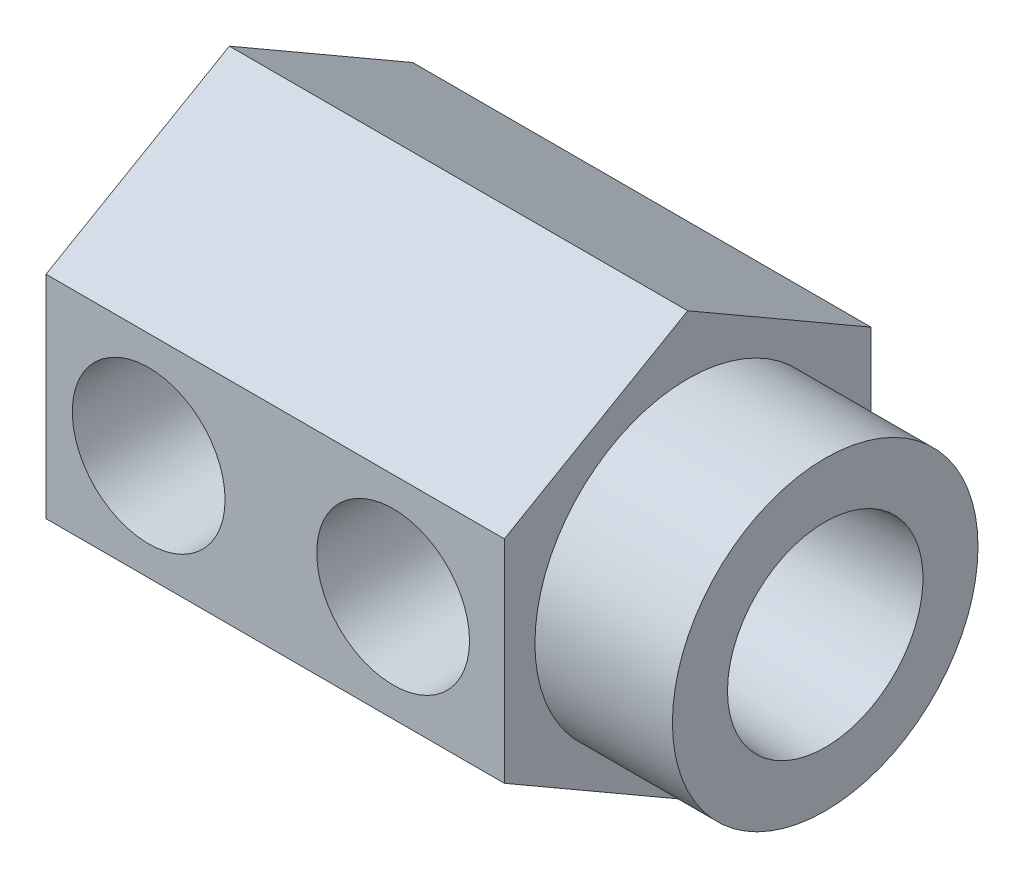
ISO-10303-21;
HEADER;
FILE_DESCRIPTION(('STEP AP214'),'2;1');
FILE_NAME('part.step','',(''),(''),'','','');
FILE_SCHEMA(('AUTOMOTIVE_DESIGN { 1 0 10303 214 1 1 1 1 }'));
ENDSEC;
DATA;
#1=APPLICATION_CONTEXT('core data for automotive mechanical design processes');
#2=APPLICATION_PROTOCOL_DEFINITION('international standard','automotive_design',2000,#1);
#3=PRODUCT_CONTEXT('',#1,'mechanical');
#4=PRODUCT('Part','Part','',(#3));
#5=PRODUCT_RELATED_PRODUCT_CATEGORY('part','',(#4));
#6=PRODUCT_DEFINITION_FORMATION('','',#4);
#7=PRODUCT_DEFINITION_CONTEXT('part definition',#1,'design');
#8=PRODUCT_DEFINITION('design','',#6,#7);
#9=PRODUCT_DEFINITION_SHAPE('','',#8);
#10=(LENGTH_UNIT() NAMED_UNIT(*) SI_UNIT(.MILLI.,.METRE.));
#11=(NAMED_UNIT(*) PLANE_ANGLE_UNIT() SI_UNIT($,.RADIAN.));
#12=(NAMED_UNIT(*) SI_UNIT($,.STERADIAN.) SOLID_ANGLE_UNIT());
#13=UNCERTAINTY_MEASURE_WITH_UNIT(LENGTH_MEASURE(1.E-05),#10,'distance_accuracy_value','');
#14=(GEOMETRIC_REPRESENTATION_CONTEXT(3) GLOBAL_UNCERTAINTY_ASSIGNED_CONTEXT((#13)) GLOBAL_UNIT_ASSIGNED_CONTEXT((#10,
#11,#12)) REPRESENTATION_CONTEXT('',''));
#15=CARTESIAN_POINT('',(0.,0.,0.));
#16=DIRECTION('',(0.,0.,1.));
#17=DIRECTION('',(1.,0.,0.));
#18=AXIS2_PLACEMENT_3D('',#15,#16,#17);
#19=CARTESIAN_POINT('',(30.95625,0.,0.));
#20=DIRECTION('',(1.,0.,0.));
#21=DIRECTION('',(0.,0.,-1.));
#22=AXIS2_PLACEMENT_3D('',#19,#20,#21);
#23=CYLINDRICAL_SURFACE('',#22,2.01929999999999);
#24=CARTESIAN_POINT('',(8.4074,0.,-2.01929999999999));
#25=CARTESIAN_POINT('',(8.40739769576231,0.101732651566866,-2.01929763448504));
#26=CARTESIAN_POINT('',(8.40230330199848,0.203487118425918,-2.01156814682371));
#27=CARTESIAN_POINT('',(8.38242696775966,0.403769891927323,-1.98111627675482));
#28=CARTESIAN_POINT('',(8.36763841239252,0.502295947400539,-1.95838365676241));
#29=CARTESIAN_POINT('',(8.32983954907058,0.692921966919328,-1.89930272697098));
#30=CARTESIAN_POINT('',(8.30686792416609,0.785049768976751,-1.86301844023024));
#31=CARTESIAN_POINT('',(8.25456289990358,0.961553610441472,-1.77836407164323));
#32=CARTESIAN_POINT('',(8.22522872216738,1.04592869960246,-1.72999251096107));
#33=CARTESIAN_POINT('',(8.15964609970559,1.21250971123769,-1.61811319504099));
#34=CARTESIAN_POINT('',(8.12302431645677,1.29394198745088,-1.55367699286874));
#35=CARTESIAN_POINT('',(8.04753547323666,1.44558097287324,-1.41369624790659));
#36=CARTESIAN_POINT('',(8.00866530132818,1.51577159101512,-1.33813607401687));
#37=CARTESIAN_POINT('',(7.9258934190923,1.65387111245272,-1.1646435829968));
#38=CARTESIAN_POINT('',(7.88212846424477,1.71979936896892,-1.065056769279));
#39=CARTESIAN_POINT('',(7.801303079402,1.83387431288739,-0.853717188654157));
#40=CARTESIAN_POINT('',(7.76423111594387,1.88205174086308,-0.741985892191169));
#41=CARTESIAN_POINT('',(7.7119677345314,1.94738073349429,-0.541345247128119));
#42=CARTESIAN_POINT('',(7.69355414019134,1.96945022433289,-0.45488432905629));
#43=CARTESIAN_POINT('',(7.66599214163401,2.00201596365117,-0.278427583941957));
#44=CARTESIAN_POINT('',(7.65682846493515,2.01253129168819,-0.188437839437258));
#45=CARTESIAN_POINT('',(7.6491750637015,2.02133454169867,-0.00705251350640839));
#46=CARTESIAN_POINT('',(7.65072484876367,2.01957720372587,0.0843470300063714));
#47=CARTESIAN_POINT('',(7.6643311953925,2.0038566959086,0.265323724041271));
#48=CARTESIAN_POINT('',(7.6763966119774,1.98988323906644,0.354899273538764));
#49=CARTESIAN_POINT('',(7.70854670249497,1.95138536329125,0.526408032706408));
#50=CARTESIAN_POINT('',(7.72830356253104,1.92728941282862,0.608502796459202));
#51=CARTESIAN_POINT('',(7.77358248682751,1.86964302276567,0.767576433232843));
#52=CARTESIAN_POINT('',(7.79910644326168,1.83608947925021,0.844553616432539));
#53=CARTESIAN_POINT('',(7.85919953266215,1.75279347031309,1.00760393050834));
#54=CARTESIAN_POINT('',(7.89455667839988,1.70115520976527,1.09241596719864));
#55=CARTESIAN_POINT('',(7.96714656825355,1.58648784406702,1.25315286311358));
#56=CARTESIAN_POINT('',(8.00438156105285,1.52344483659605,1.32906668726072));
#57=CARTESIAN_POINT('',(8.08536258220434,1.37277458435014,1.48564532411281));
#58=CARTESIAN_POINT('',(8.1288951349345,1.2827547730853,1.56414383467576));
#59=CARTESIAN_POINT('',(8.21009235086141,1.08854260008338,1.70499042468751));
#60=CARTESIAN_POINT('',(8.24776281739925,0.984364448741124,1.76735451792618));
#61=CARTESIAN_POINT('',(8.3066966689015,0.78573592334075,1.86274426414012));
#62=CARTESIAN_POINT('',(8.32973103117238,0.693427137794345,1.89913155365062));
#63=CARTESIAN_POINT('',(8.36752282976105,0.502920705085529,1.95820455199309));
#64=CARTESIAN_POINT('',(8.38228715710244,0.404728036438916,1.98090166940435));
#65=CARTESIAN_POINT('',(8.40222973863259,0.204674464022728,2.01145586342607));
#66=CARTESIAN_POINT('',(8.40737009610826,0.102800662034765,2.01925427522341));
#67=CARTESIAN_POINT('',(8.40742962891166,-0.100962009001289,2.01934530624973));
#68=CARTESIAN_POINT('',(8.40234898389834,-0.202850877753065,2.01163819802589));
#69=CARTESIAN_POINT('',(8.38312324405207,-0.396918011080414,1.982182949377));
#70=CARTESIAN_POINT('',(8.36957773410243,-0.489300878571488,1.9613629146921));
#71=CARTESIAN_POINT('',(8.33510518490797,-0.66897783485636,1.90757497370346));
#72=CARTESIAN_POINT('',(8.31417695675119,-0.756271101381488,1.87460511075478));
#73=CARTESIAN_POINT('',(8.26488584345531,-0.929706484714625,1.79524601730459));
#74=CARTESIAN_POINT('',(8.2361236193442,-1.0153928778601,1.74811508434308));
#75=CARTESIAN_POINT('',(8.17402619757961,-1.17797570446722,1.64296501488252));
#76=CARTESIAN_POINT('',(8.14068790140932,-1.25486611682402,1.58493849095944));
#77=CARTESIAN_POINT('',(8.06624147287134,-1.4103855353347,1.44935714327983));
#78=CARTESIAN_POINT('',(8.02473439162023,-1.48739922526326,1.37016708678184));
#79=CARTESIAN_POINT('',(7.94224825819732,-1.62771443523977,1.20011633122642));
#80=CARTESIAN_POINT('',(7.90126949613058,-1.69100870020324,1.10924949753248));
#81=CARTESIAN_POINT('',(7.82825690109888,-1.79670565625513,0.926991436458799));
#82=CARTESIAN_POINT('',(7.79573542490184,-1.84060940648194,0.836670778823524));
#83=CARTESIAN_POINT('',(7.73831078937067,-1.91501896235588,0.648437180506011));
#84=CARTESIAN_POINT('',(7.7133938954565,-1.94554896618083,0.550538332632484));
#85=CARTESIAN_POINT('',(7.67812773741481,-1.98783561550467,0.365463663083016));
#86=CARTESIAN_POINT('',(7.66606765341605,-2.00183885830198,0.2791355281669));
#87=CARTESIAN_POINT('',(7.65167688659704,-2.01848773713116,0.104614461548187));
#88=CARTESIAN_POINT('',(7.6493374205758,-2.02114362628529,0.0164232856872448));
#89=CARTESIAN_POINT('',(7.65474354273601,-2.0149316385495,-0.159204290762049));
#90=CARTESIAN_POINT('',(7.66248708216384,-2.00606610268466,-0.246640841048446));
#91=CARTESIAN_POINT('',(7.68688154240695,-1.97739194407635,-0.418454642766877));
#92=CARTESIAN_POINT('',(7.70354414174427,-1.95756897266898,-0.502827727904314));
#93=CARTESIAN_POINT('',(7.74935686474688,-1.90092148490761,-0.690038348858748));
#94=CARTESIAN_POINT('',(7.78070539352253,-1.86087516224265,-0.791354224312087));
#95=CARTESIAN_POINT('',(7.84983262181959,-1.76629545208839,-0.984574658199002));
#96=CARTESIAN_POINT('',(7.88762018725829,-1.71174203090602,-1.07646595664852));
#97=CARTESIAN_POINT('',(7.96610728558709,-1.58846740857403,-1.25138938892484));
#98=CARTESIAN_POINT('',(8.00684491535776,-1.51952477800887,-1.33424790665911));
#99=CARTESIAN_POINT('',(8.08699831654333,-1.36896539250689,-1.48832441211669));
#100=CARTESIAN_POINT('',(8.12641372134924,-1.28734515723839,-1.55953919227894));
#101=CARTESIAN_POINT('',(8.20502875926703,-1.10194227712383,-1.69649514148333));
#102=CARTESIAN_POINT('',(8.24365131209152,-0.996680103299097,-1.76059227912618));
#103=CARTESIAN_POINT('',(8.31070076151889,-0.773633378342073,-1.86932238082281));
#104=CARTESIAN_POINT('',(8.33914788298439,-0.655874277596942,-1.91399399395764));
#105=CARTESIAN_POINT('',(8.3758640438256,-0.44780065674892,-1.97104922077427));
#106=CARTESIAN_POINT('',(8.3876082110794,-0.359615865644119,-1.98906711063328));
#107=CARTESIAN_POINT('',(8.40337545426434,-0.180959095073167,-2.01319083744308));
#108=CARTESIAN_POINT('',(8.40740204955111,-0.0904881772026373,-2.01930210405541));
#109=CARTESIAN_POINT('',(8.4074,0.,-2.01929999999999));
#110=B_SPLINE_CURVE_WITH_KNOTS('',3,(#24,#25,#26,#27,#28,#29,#30,#31,#32,#33,#34,#35,#36,#37,
#38,#39,#40,#41,#42,#43,#44,#45,#46,#47,#48,#49,#50,#51,#52,#53,#54,#55,#56,#57,#58,#59,#60,#61,
#62,#63,#64,#65,#66,#67,#68,#69,#70,#71,#72,#73,#74,#75,#76,#77,#78,#79,#80,#81,#82,#83,#84,#85,
#86,#87,#88,#89,#90,#91,#92,#93,#94,#95,#96,#97,#98,#99,#100,#101,#102,#103,#104,#105,#106,#107,
#108,#109),.UNSPECIFIED.,.T.,.F.,(4,2,2,2,2,2,2,2,2,2,2,2,2,2,2,2,2,2,2,2,2,2,2,2,2,2,2,2,2,2,2,
2,2,2,2,2,2,2,2,2,2,2,4),(0.,0.304831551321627,0.609871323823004,0.913487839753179,
1.21714152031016,1.5462292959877,1.8757839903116,2.25560015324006,2.63475543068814,
2.90699929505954,3.17879292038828,3.45158941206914,3.72461584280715,3.98709449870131,
4.24965939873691,4.56475175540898,4.88023082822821,5.25978143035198,5.63895386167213,
5.94324908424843,6.24729037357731,6.55252640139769,6.85775706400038,7.14349539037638,
7.4292797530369,7.73391456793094,8.03875668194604,8.39136371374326,8.74415675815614,
9.05966078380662,9.3745915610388,9.63827096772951,9.90171207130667,10.165099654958,
10.4288329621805,10.7671103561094,11.1058573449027,11.4502625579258,11.7947624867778,
12.1800145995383,12.564496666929,12.8357590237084,13.1068976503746),.UNSPECIFIED.);
#111=CARTESIAN_POINT('',(7.87876849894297,1.72335163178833,-1.05244080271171));
#112=VERTEX_POINT('',#111);
#113=CARTESIAN_POINT('',(7.87876849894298,1.72335163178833,1.05244080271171));
#114=VERTEX_POINT('',#113);
#115=EDGE_CURVE('E216',#112,#114,#110,.T.);
#116=ORIENTED_EDGE('',*,*,#115,.F.);
#117=CARTESIAN_POINT('',(7.87876849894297,0.,0.));
#118=DIRECTION('',(1.,0.,0.));
#119=DIRECTION('',(0.,0.,-1.));
#120=AXIS2_PLACEMENT_3D('',#117,#118,#119);
#121=CIRCLE('',#120,2.01929999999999);
#122=EDGE_CURVE('E163',#112,#114,#121,.T.);
#123=ORIENTED_EDGE('',*,*,#122,.T.);
#124=EDGE_LOOP('',(#116,#123));
#125=FACE_BOUND('',#124,.T.);
#126=ADVANCED_FACE('F35',(#125),#23,.F.);
#127=CARTESIAN_POINT('',(30.95625,0.,0.));
#128=DIRECTION('',(1.,0.,0.));
#129=DIRECTION('',(0.,0.,-1.));
#130=AXIS2_PLACEMENT_3D('',#127,#128,#129);
#131=PLANE('',#130);
#132=CARTESIAN_POINT('',(30.95625,0.,0.));
#133=DIRECTION('',(1.,0.,0.));
#134=DIRECTION('',(0.,0.,-1.));
#135=AXIS2_PLACEMENT_3D('',#132,#133,#134);
#136=CIRCLE('',#135,7.9375);
#137=CARTESIAN_POINT('',(30.95625,0.,-7.9375));
#138=VERTEX_POINT('',#137);
#139=EDGE_CURVE('E392',#138,#138,#136,.T.);
#140=ORIENTED_EDGE('',*,*,#139,.T.);
#141=EDGE_LOOP('',(#140));
#142=FACE_BOUND('',#141,.T.);
#143=CARTESIAN_POINT('',(30.95625,0.,0.));
#144=DIRECTION('',(-1.,0.,0.));
#145=DIRECTION('',(0.,0.,1.));
#146=AXIS2_PLACEMENT_3D('',#143,#144,#145);
#147=CIRCLE('',#146,5.07746);
#148=CARTESIAN_POINT('',(30.95625,0.,5.07746));
#149=VERTEX_POINT('',#148);
#150=EDGE_CURVE('E388',#149,#149,#147,.T.);
#151=ORIENTED_EDGE('',*,*,#150,.T.);
#152=EDGE_LOOP('',(#151));
#153=FACE_BOUND('',#152,.T.);
#154=ADVANCED_FACE('F317',(#142,#153),#131,.T.);
#155=CARTESIAN_POINT('',(23.8125,-5.4992613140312,-9.525));
#156=DIRECTION('',(1.,0.,0.));
#157=DIRECTION('',(0.,0.,-1.));
#158=AXIS2_PLACEMENT_3D('',#155,#156,#157);
#159=PLANE('',#158);
#160=DIRECTION('',(0.,0.5,-0.866025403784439));
#161=VECTOR('',#160,1.);
#162=CARTESIAN_POINT('',(23.8125,-10.9985226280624,0.));
#163=LINE('',#162,#161);
#164=CARTESIAN_POINT('',(23.8125,-10.9985226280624,0.));
#165=VERTEX_POINT('',#164);
#166=CARTESIAN_POINT('',(23.8125,-5.49926131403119,-9.525));
#167=VERTEX_POINT('',#166);
#168=EDGE_CURVE('E398',#165,#167,#163,.T.);
#169=ORIENTED_EDGE('',*,*,#168,.T.);
#170=DIRECTION('',(0.,1.,0.));
#171=VECTOR('',#170,1.);
#172=CARTESIAN_POINT('',(23.8125,-5.49926131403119,-9.525));
#173=LINE('',#172,#171);
#174=CARTESIAN_POINT('',(23.8125,5.49926131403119,-9.525));
#175=VERTEX_POINT('',#174);
#176=EDGE_CURVE('E401',#167,#175,#173,.T.);
#177=ORIENTED_EDGE('',*,*,#176,.T.);
#178=DIRECTION('',(0.,0.5,0.866025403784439));
#179=VECTOR('',#178,1.);
#180=CARTESIAN_POINT('',(23.8125,5.49926131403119,-9.525));
#181=LINE('',#180,#179);
#182=CARTESIAN_POINT('',(23.8125,10.9985226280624,0.));
#183=VERTEX_POINT('',#182);
#184=EDGE_CURVE('E404',#175,#183,#181,.T.);
#185=ORIENTED_EDGE('',*,*,#184,.T.);
#186=DIRECTION('',(0.,-0.5,0.866025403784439));
#187=VECTOR('',#186,1.);
#188=CARTESIAN_POINT('',(23.8125,10.9985226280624,0.));
#189=LINE('',#188,#187);
#190=CARTESIAN_POINT('',(23.8125,5.49926131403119,9.52500000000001));
#191=VERTEX_POINT('',#190);
#192=EDGE_CURVE('E406',#183,#191,#189,.T.);
#193=ORIENTED_EDGE('',*,*,#192,.T.);
#194=DIRECTION('',(0.,-1.,0.));
#195=VECTOR('',#194,1.);
#196=CARTESIAN_POINT('',(23.8125,5.49926131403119,9.52500000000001));
#197=LINE('',#196,#195);
#198=CARTESIAN_POINT('',(23.8125,-5.49926131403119,9.52500000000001));
#199=VERTEX_POINT('',#198);
#200=EDGE_CURVE('E408',#191,#199,#197,.T.);
#201=ORIENTED_EDGE('',*,*,#200,.T.);
#202=DIRECTION('',(0.,-0.5,-0.866025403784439));
#203=VECTOR('',#202,1.);
#204=CARTESIAN_POINT('',(23.8125,-5.49926131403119,9.52500000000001));
#205=LINE('',#204,#203);
#206=EDGE_CURVE('E410',#199,#165,#205,.T.);
#207=ORIENTED_EDGE('',*,*,#206,.T.);
#208=EDGE_LOOP('',(#169,#177,#185,#193,#201,#207));
#209=FACE_BOUND('',#208,.T.);
#210=CARTESIAN_POINT('',(23.8125,0.,0.));
#211=DIRECTION('',(1.,0.,0.));
#212=DIRECTION('',(0.,0.,-1.));
#213=AXIS2_PLACEMENT_3D('',#210,#211,#212);
#214=CIRCLE('',#213,7.9375);
#215=CARTESIAN_POINT('',(23.8125,0.,-7.9375));
#216=VERTEX_POINT('',#215);
#217=EDGE_CURVE('E391',#216,#216,#214,.T.);
#218=ORIENTED_EDGE('',*,*,#217,.F.);
#219=EDGE_LOOP('',(#218));
#220=FACE_BOUND('',#219,.T.);
#221=ADVANCED_FACE('F322',(#209,#220),#159,.T.);
#222=CARTESIAN_POINT('',(23.8125,-10.9985226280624,0.));
#223=DIRECTION('',(0.,0.866025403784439,0.5));
#224=DIRECTION('',(0.,-0.5,0.866025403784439));
#225=AXIS2_PLACEMENT_3D('',#222,#223,#224);
#226=PLANE('',#225);
#227=DIRECTION('',(0.,0.5,-0.866025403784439));
#228=VECTOR('',#227,1.);
#229=CARTESIAN_POINT('',(0.,-10.9985226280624,0.));
#230=LINE('',#229,#228);
#231=CARTESIAN_POINT('',(0.,-10.9985226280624,0.));
#232=VERTEX_POINT('',#231);
#233=CARTESIAN_POINT('',(0.,-5.49926131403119,-9.525));
#234=VERTEX_POINT('',#233);
#235=EDGE_CURVE('E395',#232,#234,#230,.T.);
#236=ORIENTED_EDGE('',*,*,#235,.T.);
#237=DIRECTION('',(-1.,0.,0.));
#238=VECTOR('',#237,1.);
#239=CARTESIAN_POINT('',(23.8125,-5.49926131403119,-9.525));
#240=LINE('',#239,#238);
#241=EDGE_CURVE('E437',#167,#234,#240,.T.);
#242=ORIENTED_EDGE('',*,*,#241,.F.);
#243=ORIENTED_EDGE('',*,*,#168,.F.);
#244=DIRECTION('',(-1.,0.,0.));
#245=VECTOR('',#244,1.);
#246=CARTESIAN_POINT('',(23.8125,-10.9985226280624,0.));
#247=LINE('',#246,#245);
#248=EDGE_CURVE('E412',#165,#232,#247,.T.);
#249=ORIENTED_EDGE('',*,*,#248,.T.);
#250=EDGE_LOOP('',(#236,#242,#243,#249));
#251=FACE_BOUND('',#250,.T.);
#252=ADVANCED_FACE('F37',(#251),#226,.F.);
#253=CARTESIAN_POINT('',(23.8125,-5.49926131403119,-9.525));
#254=DIRECTION('',(0.,0.,1.));
#255=DIRECTION('',(1.,0.,0.));
#256=AXIS2_PLACEMENT_3D('',#253,#254,#255);
#257=PLANE('',#256);
#258=CARTESIAN_POINT('',(5.334,0.,-9.525));
#259=DIRECTION('',(0.,0.,-1.));
#260=DIRECTION('',(-1.,0.,0.));
#261=AXIS2_PLACEMENT_3D('',#258,#259,#260);
#262=CIRCLE('',#261,3.96875);
#263=CARTESIAN_POINT('',(1.36525,0.,-9.525));
#264=VERTEX_POINT('',#263);
#265=EDGE_CURVE('E233',#264,#264,#262,.T.);
#266=ORIENTED_EDGE('',*,*,#265,.F.);
#267=EDGE_LOOP('',(#266));
#268=FACE_BOUND('',#267,.T.);
#269=DIRECTION('',(0.,1.,0.));
#270=VECTOR('',#269,1.);
#271=CARTESIAN_POINT('',(0.,-5.49926131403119,-9.525));
#272=LINE('',#271,#270);
#273=CARTESIAN_POINT('',(0.,5.49926131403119,-9.525));
#274=VERTEX_POINT('',#273);
#275=EDGE_CURVE('E415',#234,#274,#272,.T.);
#276=ORIENTED_EDGE('',*,*,#275,.T.);
#277=DIRECTION('',(-1.,0.,0.));
#278=VECTOR('',#277,1.);
#279=CARTESIAN_POINT('',(23.8125,5.49926131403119,-9.525));
#280=LINE('',#279,#278);
#281=EDGE_CURVE('E435',#175,#274,#280,.T.);
#282=ORIENTED_EDGE('',*,*,#281,.F.);
#283=ORIENTED_EDGE('',*,*,#176,.F.);
#284=ORIENTED_EDGE('',*,*,#241,.T.);
#285=EDGE_LOOP('',(#276,#282,#283,#284));
#286=FACE_BOUND('',#285,.T.);
#287=ADVANCED_FACE('F614',(#268,#286),#257,.F.);
#288=CARTESIAN_POINT('',(23.8125,5.49926131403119,-9.525));
#289=DIRECTION('',(0.,-0.866025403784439,0.5));
#290=DIRECTION('',(0.,-0.5,-0.866025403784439));
#291=AXIS2_PLACEMENT_3D('',#288,#289,#290);
#292=PLANE('',#291);
#293=DIRECTION('',(0.,0.5,0.866025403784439));
#294=VECTOR('',#293,1.);
#295=CARTESIAN_POINT('',(0.,5.49926131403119,-9.525));
#296=LINE('',#295,#294);
#297=CARTESIAN_POINT('',(0.,10.9985226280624,0.));
#298=VERTEX_POINT('',#297);
#299=EDGE_CURVE('E417',#274,#298,#296,.T.);
#300=ORIENTED_EDGE('',*,*,#299,.T.);
#301=DIRECTION('',(-1.,0.,0.));
#302=VECTOR('',#301,1.);
#303=CARTESIAN_POINT('',(23.8125,10.9985226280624,0.));
#304=LINE('',#303,#302);
#305=EDGE_CURVE('E432',#183,#298,#304,.T.);
#306=ORIENTED_EDGE('',*,*,#305,.F.);
#307=ORIENTED_EDGE('',*,*,#184,.F.);
#308=ORIENTED_EDGE('',*,*,#281,.T.);
#309=EDGE_LOOP('',(#300,#306,#307,#308));
#310=FACE_BOUND('',#309,.T.);
#311=ADVANCED_FACE('F613',(#310),#292,.F.);
#312=CARTESIAN_POINT('',(23.8125,10.9985226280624,0.));
#313=DIRECTION('',(0.,-0.866025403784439,-0.5));
#314=DIRECTION('',(0.,0.5,-0.866025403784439));
#315=AXIS2_PLACEMENT_3D('',#312,#313,#314);
#316=PLANE('',#315);
#317=DIRECTION('',(0.,-0.5,0.866025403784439));
#318=VECTOR('',#317,1.);
#319=CARTESIAN_POINT('',(0.,10.9985226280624,0.));
#320=LINE('',#319,#318);
#321=CARTESIAN_POINT('',(0.,5.49926131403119,9.52500000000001));
#322=VERTEX_POINT('',#321);
#323=EDGE_CURVE('E419',#298,#322,#320,.T.);
#324=ORIENTED_EDGE('',*,*,#323,.T.);
#325=DIRECTION('',(-1.,0.,0.));
#326=VECTOR('',#325,1.);
#327=CARTESIAN_POINT('',(23.8125,5.49926131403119,9.52500000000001));
#328=LINE('',#327,#326);
#329=EDGE_CURVE('E429',#191,#322,#328,.T.);
#330=ORIENTED_EDGE('',*,*,#329,.F.);
#331=ORIENTED_EDGE('',*,*,#192,.F.);
#332=ORIENTED_EDGE('',*,*,#305,.T.);
#333=EDGE_LOOP('',(#324,#330,#331,#332));
#334=FACE_BOUND('',#333,.T.);
#335=ADVANCED_FACE('F586',(#334),#316,.F.);
#336=CARTESIAN_POINT('',(23.8125,5.49926131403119,9.52500000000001));
#337=DIRECTION('',(0.,0.,-1.));
#338=DIRECTION('',(-1.,0.,0.));
#339=AXIS2_PLACEMENT_3D('',#336,#337,#338);
#340=PLANE('',#339);
#341=CARTESIAN_POINT('',(5.334,0.,9.52500000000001));
#342=DIRECTION('',(0.,0.,1.));
#343=DIRECTION('',(1.,0.,0.));
#344=AXIS2_PLACEMENT_3D('',#341,#342,#343);
#345=CIRCLE('',#344,3.96875);
#346=CARTESIAN_POINT('',(9.30275,0.,9.52500000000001));
#347=VERTEX_POINT('',#346);
#348=EDGE_CURVE('E221',#347,#347,#345,.T.);
#349=ORIENTED_EDGE('',*,*,#348,.F.);
#350=EDGE_LOOP('',(#349));
#351=FACE_BOUND('',#350,.T.);
#352=CARTESIAN_POINT('',(18.034,0.,9.52500000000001));
#353=DIRECTION('',(0.,0.,1.));
#354=DIRECTION('',(1.,0.,0.));
#355=AXIS2_PLACEMENT_3D('',#352,#353,#354);
#356=CIRCLE('',#355,3.96875);
#357=CARTESIAN_POINT('',(22.00275,0.,9.52500000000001));
#358=VERTEX_POINT('',#357);
#359=EDGE_CURVE('E341',#358,#358,#356,.T.);
#360=ORIENTED_EDGE('',*,*,#359,.F.);
#361=EDGE_LOOP('',(#360));
#362=FACE_BOUND('',#361,.T.);
#363=DIRECTION('',(0.,-1.,0.));
#364=VECTOR('',#363,1.);
#365=CARTESIAN_POINT('',(0.,5.49926131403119,9.52500000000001));
#366=LINE('',#365,#364);
#367=CARTESIAN_POINT('',(0.,-5.49926131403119,9.52500000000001));
#368=VERTEX_POINT('',#367);
#369=EDGE_CURVE('E421',#322,#368,#366,.T.);
#370=ORIENTED_EDGE('',*,*,#369,.T.);
#371=DIRECTION('',(-1.,0.,0.));
#372=VECTOR('',#371,1.);
#373=CARTESIAN_POINT('',(23.8125,-5.49926131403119,9.52500000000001));
#374=LINE('',#373,#372);
#375=EDGE_CURVE('E426',#199,#368,#374,.T.);
#376=ORIENTED_EDGE('',*,*,#375,.F.);
#377=ORIENTED_EDGE('',*,*,#200,.F.);
#378=ORIENTED_EDGE('',*,*,#329,.T.);
#379=EDGE_LOOP('',(#370,#376,#377,#378));
#380=FACE_BOUND('',#379,.T.);
#381=ADVANCED_FACE('F582',(#351,#362,#380),#340,.F.);
#382=CARTESIAN_POINT('',(23.8125,-5.49926131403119,9.52500000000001));
#383=DIRECTION('',(0.,0.866025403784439,-0.5));
#384=DIRECTION('',(0.,0.5,0.866025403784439));
#385=AXIS2_PLACEMENT_3D('',#382,#383,#384);
#386=PLANE('',#385);
#387=DIRECTION('',(0.,-0.5,-0.866025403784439));
#388=VECTOR('',#387,1.);
#389=CARTESIAN_POINT('',(0.,-5.49926131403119,9.52500000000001));
#390=LINE('',#389,#388);
#391=EDGE_CURVE('E402',#368,#232,#390,.T.);
#392=ORIENTED_EDGE('',*,*,#391,.T.);
#393=ORIENTED_EDGE('',*,*,#248,.F.);
#394=ORIENTED_EDGE('',*,*,#206,.F.);
#395=ORIENTED_EDGE('',*,*,#375,.T.);
#396=EDGE_LOOP('',(#392,#393,#394,#395));
#397=FACE_BOUND('',#396,.T.);
#398=ADVANCED_FACE('F585',(#397),#386,.F.);
#399=CARTESIAN_POINT('',(0.,-5.4992613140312,-9.525));
#400=DIRECTION('',(1.,0.,0.));
#401=DIRECTION('',(0.,0.,-1.));
#402=AXIS2_PLACEMENT_3D('',#399,#400,#401);
#403=PLANE('',#402);
#404=ORIENTED_EDGE('',*,*,#235,.F.);
#405=ORIENTED_EDGE('',*,*,#391,.F.);
#406=ORIENTED_EDGE('',*,*,#369,.F.);
#407=ORIENTED_EDGE('',*,*,#323,.F.);
#408=ORIENTED_EDGE('',*,*,#299,.F.);
#409=ORIENTED_EDGE('',*,*,#275,.F.);
#410=EDGE_LOOP('',(#404,#405,#406,#407,#408,#409));
#411=FACE_BOUND('',#410,.T.);
#412=ADVANCED_FACE('F601',(#411),#403,.F.);
#413=CARTESIAN_POINT('',(30.95625,0.,0.));
#414=DIRECTION('',(-1.,0.,0.));
#415=DIRECTION('',(0.,0.,1.));
#416=AXIS2_PLACEMENT_3D('',#413,#414,#415);
#417=CYLINDRICAL_SURFACE('',#416,7.9375);
#418=ORIENTED_EDGE('',*,*,#139,.F.);
#419=EDGE_LOOP('',(#418));
#420=FACE_BOUND('',#419,.T.);
#421=ORIENTED_EDGE('',*,*,#217,.T.);
#422=EDGE_LOOP('',(#421));
#423=FACE_BOUND('',#422,.T.);
#424=ADVANCED_FACE('F629',(#420,#423),#417,.T.);
#425=CARTESIAN_POINT('',(30.95625,0.,0.));
#426=DIRECTION('',(1.,0.,0.));
#427=DIRECTION('',(0.,0.,-1.));
#428=AXIS2_PLACEMENT_3D('',#425,#426,#427);
#429=CONICAL_SURFACE('',#428,5.07746,0.0523598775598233);
#430=CARTESIAN_POINT('',(23.97125,0.,0.));
#431=DIRECTION('',(-1.,0.,0.));
#432=DIRECTION('',(0.,0.,1.));
#433=AXIS2_PLACEMENT_3D('',#430,#431,#432);
#434=CIRCLE('',#433,4.711391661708);
#435=CARTESIAN_POINT('',(23.97125,0.,4.711391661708));
#436=VERTEX_POINT('',#435);
#437=EDGE_CURVE('E380',#436,#436,#434,.T.);
#438=ORIENTED_EDGE('',*,*,#437,.T.);
#439=EDGE_LOOP('',(#438));
#440=FACE_BOUND('',#439,.T.);
#441=ORIENTED_EDGE('',*,*,#150,.F.);
#442=EDGE_LOOP('',(#441));
#443=FACE_BOUND('',#442,.T.);
#444=ADVANCED_FACE('F633',(#440,#443),#429,.F.);
#445=CARTESIAN_POINT('',(23.97125,0.,-3.41629999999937));
#446=DIRECTION('',(1.,0.,0.));
#447=DIRECTION('',(0.,0.,-1.));
#448=AXIS2_PLACEMENT_3D('',#445,#446,#447);
#449=PLANE('',#448);
#450=CARTESIAN_POINT('',(23.97125,0.,0.));
#451=DIRECTION('',(-1.,0.,0.));
#452=DIRECTION('',(0.,0.,1.));
#453=AXIS2_PLACEMENT_3D('',#450,#451,#452);
#454=CIRCLE('',#453,3.41629999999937);
#455=CARTESIAN_POINT('',(23.97125,0.,3.41629999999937));
#456=VERTEX_POINT('',#455);
#457=EDGE_CURVE('E376',#456,#456,#454,.T.);
#458=ORIENTED_EDGE('',*,*,#457,.T.);
#459=EDGE_LOOP('',(#458));
#460=FACE_BOUND('',#459,.T.);
#461=ORIENTED_EDGE('',*,*,#437,.F.);
#462=EDGE_LOOP('',(#461));
#463=FACE_BOUND('',#462,.T.);
#464=ADVANCED_FACE('F312',(#460,#463),#449,.T.);
#465=CARTESIAN_POINT('',(-5.61637673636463,0.,0.));
#466=DIRECTION('',(-1.,0.,0.));
#467=DIRECTION('',(0.,0.,1.));
#468=AXIS2_PLACEMENT_3D('',#465,#466,#467);
#469=CYLINDRICAL_SURFACE('',#468,3.41629999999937);
#470=CARTESIAN_POINT('',(21.1074,0.,-3.41629999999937));
#471=CARTESIAN_POINT('',(21.1073906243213,0.142457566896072,-3.41629074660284));
#472=CARTESIAN_POINT('',(21.0974162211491,0.284993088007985,-3.40730981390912));
#473=CARTESIAN_POINT('',(21.0582943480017,0.56526004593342,-3.37218076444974));
#474=CARTESIAN_POINT('',(21.0291272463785,0.702986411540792,-3.34601506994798));
#475=CARTESIAN_POINT('',(20.9539481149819,0.968849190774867,-3.27889164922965));
#476=CARTESIAN_POINT('',(20.9080443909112,1.09704102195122,-3.23802905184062));
#477=CARTESIAN_POINT('',(20.8019209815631,1.34250340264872,-3.14421552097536));
#478=CARTESIAN_POINT('',(20.7416960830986,1.45976995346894,-3.09126018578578));
#479=CARTESIAN_POINT('',(20.5830972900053,1.72643638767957,-2.95315649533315));
#480=CARTESIAN_POINT('',(20.4790627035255,1.87015856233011,-2.86356607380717));
#481=CARTESIAN_POINT('',(20.2527087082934,2.13388777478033,-2.67286201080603));
#482=CARTESIAN_POINT('',(20.1303443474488,2.25383477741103,-2.57172018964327));
#483=CARTESIAN_POINT('',(19.9338160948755,2.41742888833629,-2.41516689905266));
#484=CARTESIAN_POINT('',(19.865262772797,2.46975022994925,-2.36151942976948));
#485=CARTESIAN_POINT('',(19.7241991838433,2.56835019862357,-2.25388595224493));
#486=CARTESIAN_POINT('',(19.6516899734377,2.61463042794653,-2.19990003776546));
#487=CARTESIAN_POINT('',(19.5027314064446,2.70111536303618,-2.09279951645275));
#488=CARTESIAN_POINT('',(19.426288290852,2.7413293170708,-2.03968369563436));
#489=CARTESIAN_POINT('',(19.2690478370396,2.81567123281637,-1.93576189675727));
#490=CARTESIAN_POINT('',(19.1882533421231,2.84980310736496,-1.88495444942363));
#491=CARTESIAN_POINT('',(19.0219129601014,2.91164408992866,-1.78793937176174));
#492=CARTESIAN_POINT('',(18.9363825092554,2.93937269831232,-1.74171802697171));
#493=CARTESIAN_POINT('',(18.7596212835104,2.98791621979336,-1.65705658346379));
#494=CARTESIAN_POINT('',(18.6683962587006,3.0087379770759,-1.61860879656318));
#495=CARTESIAN_POINT('',(18.4959301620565,3.03952516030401,-1.55990772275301));
#496=CARTESIAN_POINT('',(18.4156107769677,3.05073125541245,-1.53767680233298));
#497=CARTESIAN_POINT('',(18.2520056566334,3.06675275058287,-1.50548144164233));
#498=CARTESIAN_POINT('',(18.1687284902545,3.0715852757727,-1.4954841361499));
#499=CARTESIAN_POINT('',(18.0010923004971,3.07437135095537,-1.48975286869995));
#500=CARTESIAN_POINT('',(17.9167298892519,3.07228853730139,-1.49409430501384));
#501=CARTESIAN_POINT('',(17.7501821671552,3.06141172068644,-1.51624518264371));
#502=CARTESIAN_POINT('',(17.6680020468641,3.05260298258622,-1.53408419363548));
#503=CARTESIAN_POINT('',(17.4729486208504,3.02398919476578,-1.58994377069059));
#504=CARTESIAN_POINT('',(17.3621398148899,3.00107873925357,-1.63335206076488));
#505=CARTESIAN_POINT('',(17.1485749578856,2.94518173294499,-1.73212104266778));
#506=CARTESIAN_POINT('',(17.0458550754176,2.91215283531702,-1.78753167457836));
#507=CARTESIAN_POINT('',(16.8549976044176,2.83995043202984,-1.89998166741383));
#508=CARTESIAN_POINT('',(16.7663447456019,2.80143104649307,-1.95658047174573));
#509=CARTESIAN_POINT('',(16.5942445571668,2.71699966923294,-2.07223389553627));
#510=CARTESIAN_POINT('',(16.5108012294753,2.67108208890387,-2.13129034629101));
#511=CARTESIAN_POINT('',(16.3488100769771,2.57195064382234,-2.24992301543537));
#512=CARTESIAN_POINT('',(16.2702606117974,2.51873924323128,-2.30949905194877));
#513=CARTESIAN_POINT('',(16.1179919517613,2.40493916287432,-2.42778009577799));
#514=CARTESIAN_POINT('',(16.0442737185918,2.34434902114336,-2.486484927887));
#515=CARTESIAN_POINT('',(15.8513952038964,2.17001201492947,-2.64271694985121));
#516=CARTESIAN_POINT('',(15.7370373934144,2.04901466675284,-2.73828635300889));
#517=CARTESIAN_POINT('',(15.5262353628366,1.78474938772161,-2.91739010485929));
#518=CARTESIAN_POINT('',(15.4297539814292,1.64152882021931,-3.00094933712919));
#519=CARTESIAN_POINT('',(15.2789335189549,1.36887485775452,-3.13284294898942));
#520=CARTESIAN_POINT('',(15.2200027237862,1.2437766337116,-3.18486295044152));
#521=CARTESIAN_POINT('',(15.1184268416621,0.982245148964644,-3.27495514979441));
#522=CARTESIAN_POINT('',(15.0757725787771,0.845818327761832,-3.31303520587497));
#523=CARTESIAN_POINT('',(15.0259678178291,0.634703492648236,-3.35760685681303));
#524=CARTESIAN_POINT('',(15.0116986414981,0.562929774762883,-3.37040024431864));
#525=CARTESIAN_POINT('',(14.9882617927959,0.417909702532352,-3.39143210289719));
#526=CARTESIAN_POINT('',(14.9790916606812,0.344664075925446,-3.39967277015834));
#527=CARTESIAN_POINT('',(14.9660509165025,0.197338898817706,-3.41139583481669));
#528=CARTESIAN_POINT('',(14.9621790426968,0.123259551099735,-3.41487936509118));
#529=CARTESIAN_POINT('',(14.9598058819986,-0.0250305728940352,-3.41701450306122));
#530=CARTESIAN_POINT('',(14.961304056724,-0.0992413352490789,-3.41566659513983));
#531=CARTESIAN_POINT('',(14.9728587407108,-0.303677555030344,-3.40527356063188));
#532=CARTESIAN_POINT('',(14.988577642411,-0.433397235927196,-3.39113605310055));
#533=CARTESIAN_POINT('',(15.0356843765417,-0.687487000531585,-3.34889668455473));
#534=CARTESIAN_POINT('',(15.0670744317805,-0.811856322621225,-3.32079284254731));
#535=CARTESIAN_POINT('',(15.1447062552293,-1.055723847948,-3.25161743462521));
#536=CARTESIAN_POINT('',(15.1913035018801,-1.17501935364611,-3.21023592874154));
#537=CARTESIAN_POINT('',(15.2969019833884,-1.4035545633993,-3.1171157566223));
#538=CARTESIAN_POINT('',(15.3559084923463,-1.51278996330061,-3.06537268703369));
#539=CARTESIAN_POINT('',(15.5164413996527,-1.77233980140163,-2.92593514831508));
#540=CARTESIAN_POINT('',(15.6244943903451,-1.91596062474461,-2.83318323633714));
#541=CARTESIAN_POINT('',(15.8002449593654,-2.11279907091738,-2.68588349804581));
#542=CARTESIAN_POINT('',(15.8612383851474,-2.17541615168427,-2.63531576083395));
#543=CARTESIAN_POINT('',(15.9874380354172,-2.29453449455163,-2.53227207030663));
#544=CARTESIAN_POINT('',(16.0526427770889,-2.35103789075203,-2.47979679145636));
#545=CARTESIAN_POINT('',(16.1885856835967,-2.45926087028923,-2.37256880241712));
#546=CARTESIAN_POINT('',(16.2594176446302,-2.51083752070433,-2.31779153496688));
#547=CARTESIAN_POINT('',(16.4051624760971,-2.60774464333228,-2.20819337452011));
#548=CARTESIAN_POINT('',(16.480074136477,-2.653076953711,-2.1533724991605));
#549=CARTESIAN_POINT('',(16.6340283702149,-2.73743692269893,-2.04505374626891));
#550=CARTESIAN_POINT('',(16.7130627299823,-2.77647652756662,-1.99155352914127));
#551=CARTESIAN_POINT('',(16.8757896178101,-2.84819921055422,-1.88755018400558));
#552=CARTESIAN_POINT('',(16.9594781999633,-2.88088757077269,-1.83704458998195));
#553=CARTESIAN_POINT('',(17.127249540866,-2.93785270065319,-1.74439302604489));
#554=CARTESIAN_POINT('',(17.2110250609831,-2.96250867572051,-1.70193139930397));
#555=CARTESIAN_POINT('',(17.3839551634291,-3.00518460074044,-1.62538880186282));
#556=CARTESIAN_POINT('',(17.4731014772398,-3.02321446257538,-1.59129533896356));
#557=CARTESIAN_POINT('',(17.6419171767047,-3.04928140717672,-1.54067461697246));
#558=CARTESIAN_POINT('',(17.720803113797,-3.058459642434,-1.52220345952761));
#559=CARTESIAN_POINT('',(17.8808819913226,-3.07062681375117,-1.49751869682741));
#560=CARTESIAN_POINT('',(17.9620695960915,-3.07362903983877,-1.4912787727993));
#561=CARTESIAN_POINT('',(18.1245222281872,-3.07314284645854,-1.49227919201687));
#562=CARTESIAN_POINT('',(18.2057870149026,-3.06963972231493,-1.49955007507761));
#563=CARTESIAN_POINT('',(18.3658523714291,-3.05649264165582,-1.52616057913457));
#564=CARTESIAN_POINT('',(18.4446471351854,-3.0468352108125,-1.54552667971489));
#565=CARTESIAN_POINT('',(18.6411074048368,-3.01527767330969,-1.60652028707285));
#566=CARTESIAN_POINT('',(18.7561047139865,-2.98955853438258,-1.65453716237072));
#567=CARTESIAN_POINT('',(18.9774267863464,-2.92729500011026,-1.76237184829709));
#568=CARTESIAN_POINT('',(19.0837112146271,-2.8907035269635,-1.82224059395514));
#569=CARTESIAN_POINT('',(19.278873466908,-2.81176552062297,-1.94157617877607));
#570=CARTESIAN_POINT('',(19.3684410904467,-2.77031588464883,-2.00052360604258));
#571=CARTESIAN_POINT('',(19.5422377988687,-2.67966824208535,-2.12041024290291));
#572=CARTESIAN_POINT('',(19.6264630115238,-2.63046470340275,-2.18135084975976));
#573=CARTESIAN_POINT('',(19.7897700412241,-2.52438599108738,-2.30328258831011));
#574=CARTESIAN_POINT('',(19.8688559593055,-2.46751704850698,-2.36427363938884));
#575=CARTESIAN_POINT('',(20.0218913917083,-2.34597990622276,-2.48491905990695));
#576=CARTESIAN_POINT('',(20.0958401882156,-2.28131062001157,-2.54457324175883));
#577=CARTESIAN_POINT('',(20.2819798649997,-2.1018729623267,-2.69710341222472));
#578=CARTESIAN_POINT('',(20.3898225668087,-1.98069618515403,-2.7879259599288));
#579=CARTESIAN_POINT('',(20.5880588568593,-1.71744050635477,-2.95735105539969));
#580=CARTESIAN_POINT('',(20.6784836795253,-1.57539984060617,-3.03597542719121));
#581=CARTESIAN_POINT('',(20.8203169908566,-1.3039919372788,-3.16037812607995));
#582=CARTESIAN_POINT('',(20.8759338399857,-1.17841159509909,-3.20958492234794));
#583=CARTESIAN_POINT('',(20.9707669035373,-0.916765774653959,-3.29384915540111));
#584=CARTESIAN_POINT('',(21.0100080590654,-0.780716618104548,-3.32892810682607));
#585=CARTESIAN_POINT('',(21.0620001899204,-0.536986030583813,-3.37550132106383));
#586=CARTESIAN_POINT('',(21.0789513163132,-0.430897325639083,-3.39072586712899));
#587=CARTESIAN_POINT('',(21.1016550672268,-0.216554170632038,-3.41112897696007));
#588=CARTESIAN_POINT('',(21.1074071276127,-0.108299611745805,-3.41630703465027));
#589=CARTESIAN_POINT('',(21.1074,0.,-3.41629999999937));
#590=B_SPLINE_CURVE_WITH_KNOTS('',3,(#470,#471,#472,#473,#474,#475,#476,#477,#478,#479,#480,
#481,#482,#483,#484,#485,#486,#487,#488,#489,#490,#491,#492,#493,#494,#495,#496,#497,#498,#499,
#500,#501,#502,#503,#504,#505,#506,#507,#508,#509,#510,#511,#512,#513,#514,#515,#516,#517,#518,
#519,#520,#521,#522,#523,#524,#525,#526,#527,#528,#529,#530,#531,#532,#533,#534,#535,#536,#537,
#538,#539,#540,#541,#542,#543,#544,#545,#546,#547,#548,#549,#550,#551,#552,#553,#554,#555,#556,
#557,#558,#559,#560,#561,#562,#563,#564,#565,#566,#567,#568,#569,#570,#571,#572,#573,#574,#575,
#576,#577,#578,#579,#580,#581,#582,#583,#584,#585,#586,#587,#588,#589),.UNSPECIFIED.,.T.,.F.,(4,
2,2,2,2,2,2,2,2,2,2,2,2,2,2,2,2,2,2,2,2,2,2,2,2,2,2,2,2,2,2,2,2,2,2,2,2,2,2,2,2,2,2,2,2,2,2,2,2,
2,2,2,2,2,2,2,2,2,2,4),(0.,0.426905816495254,0.854248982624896,1.27887444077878,1.7036547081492,
2.29674049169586,2.89130532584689,3.19578881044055,3.50019137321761,3.80412506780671,
4.10786251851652,4.41066240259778,4.71316133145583,4.96448724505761,5.21513648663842,
5.46710582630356,5.71962876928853,6.08116121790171,6.4442278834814,6.77982012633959,
7.11566707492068,7.45140083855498,7.78720123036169,8.36088009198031,8.93335267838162,
9.37493030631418,9.8162586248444,10.0388467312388,10.2613273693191,10.4837550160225,
10.7061603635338,11.0984232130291,11.4907417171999,11.8929806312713,12.2953908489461,
12.8985583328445,13.201316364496,13.5039683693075,13.8137045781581,14.1233494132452,
14.4323993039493,14.7411910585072,15.0319860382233,15.3223442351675,15.5659778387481,
15.8090866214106,16.0527455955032,16.2969398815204,16.6765146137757,17.0577574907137,
17.4021870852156,17.7468635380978,18.0912614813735,18.4357074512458,18.9913179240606,
19.5459225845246,19.9819097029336,20.4172303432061,20.7417578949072,21.0663017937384),.UNSPECIFIED.);
#591=CARTESIAN_POINT('',(21.1074,0.,-3.41629999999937));
#592=VERTEX_POINT('',#591);
#593=EDGE_CURVE('E225',#592,#592,#590,.T.);
#594=ORIENTED_EDGE('',*,*,#593,.F.);
#595=EDGE_LOOP('',(#594));
#596=FACE_BOUND('',#595,.T.);
#597=CARTESIAN_POINT('',(14.9600111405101,-2.16968283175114,2.63886000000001));
#598=CARTESIAN_POINT('',(14.9150189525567,-2.10853489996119,2.68912119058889));
#599=CARTESIAN_POINT('',(14.8712851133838,-2.04512144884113,2.73770979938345));
#600=CARTESIAN_POINT('',(14.7867636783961,-1.91360919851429,2.83121060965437));
#601=CARTESIAN_POINT('',(14.7459805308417,-1.84550361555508,2.87611727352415));
#602=CARTESIAN_POINT('',(14.6308304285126,-1.63768444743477,3.00247948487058));
#603=CARTESIAN_POINT('',(14.5613875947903,-1.4914374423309,3.07810382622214));
#604=CARTESIAN_POINT('',(14.462957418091,-1.24045751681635,3.18488334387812));
#605=CARTESIAN_POINT('',(14.4285115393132,-1.14040554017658,3.22213569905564));
#606=CARTESIAN_POINT('',(14.3673839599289,-0.933479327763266,3.28811991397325));
#607=CARTESIAN_POINT('',(14.3408265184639,-0.826525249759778,3.31671553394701));
#608=CARTESIAN_POINT('',(14.31905,-0.71730556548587,3.34014646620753));
#609=B_SPLINE_CURVE_WITH_KNOTS('',3,(#597,#598,#599,#600,#601,#602,#603,#604,#605,#606,#607,
#608),.UNSPECIFIED.,.F.,.F.,(4,2,2,2,2,4),(0.,0.273021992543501,0.546447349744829,
1.07976341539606,1.41559322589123,1.75646224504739),.UNSPECIFIED.);
#610=CARTESIAN_POINT('',(14.9598321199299,-2.16943956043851,2.63906000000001));
#611=VERTEX_POINT('',#610);
#612=CARTESIAN_POINT('',(14.31925,-0.718306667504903,3.33993131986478));
#613=VERTEX_POINT('',#612);
#614=EDGE_CURVE('E224',#611,#613,#609,.T.);
#615=ORIENTED_EDGE('',*,*,#614,.F.);
#616=DIRECTION('',(-1.,0.,0.));
#617=VECTOR('',#616,1.);
#618=CARTESIAN_POINT('',(-5.61637673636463,-2.16943956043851,2.63906000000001));
#619=LINE('',#618,#617);
#620=CARTESIAN_POINT('',(15.8570021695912,-2.16943956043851,2.63906000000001));
#621=VERTEX_POINT('',#620);
#622=EDGE_CURVE('E272',#621,#611,#619,.T.);
#623=ORIENTED_EDGE('',*,*,#622,.F.);
#624=CARTESIAN_POINT('',(20.2109978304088,-2.16943956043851,2.63906000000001));
#625=CARTESIAN_POINT('',(20.1714390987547,-2.20913157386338,2.60643078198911));
#626=CARTESIAN_POINT('',(20.1309974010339,-2.24754794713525,2.57334996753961));
#627=CARTESIAN_POINT('',(20.0484095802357,-2.32185933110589,2.50650631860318));
#628=CARTESIAN_POINT('',(20.006263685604,-2.35775467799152,2.47274357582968));
#629=CARTESIAN_POINT('',(19.8771442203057,-2.46188193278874,2.37059140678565));
#630=CARTESIAN_POINT('',(19.7876748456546,-2.52636926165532,2.30149304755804));
#631=CARTESIAN_POINT('',(19.6003931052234,-2.64666702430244,2.16215138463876));
#632=CARTESIAN_POINT('',(19.5024493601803,-2.70227739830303,2.09191292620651));
#633=CARTESIAN_POINT('',(19.2993704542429,-2.80311808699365,1.95469595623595));
#634=CARTESIAN_POINT('',(19.1942473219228,-2.84836523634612,1.88771229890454));
#635=CARTESIAN_POINT('',(19.0022026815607,-2.91823431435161,1.77713104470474));
#636=CARTESIAN_POINT('',(18.9171298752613,-2.94519355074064,1.73182401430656));
#637=CARTESIAN_POINT('',(18.7415661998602,-2.99221635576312,1.6492389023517));
#638=CARTESIAN_POINT('',(18.6510955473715,-3.01230396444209,1.611933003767));
#639=CARTESIAN_POINT('',(18.479793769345,-3.04192325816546,1.55520804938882));
#640=CARTESIAN_POINT('',(18.399836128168,-3.05264996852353,1.53385305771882));
#641=CARTESIAN_POINT('',(18.2371057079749,-3.06776305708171,1.50341003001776));
#642=CARTESIAN_POINT('',(18.1543407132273,-3.07216570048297,1.49429052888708));
#643=CARTESIAN_POINT('',(17.9879763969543,-3.07418502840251,1.49013496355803));
#644=CARTESIAN_POINT('',(17.9043749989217,-3.07177123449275,1.49516215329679));
#645=CARTESIAN_POINT('',(17.7394069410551,-3.06037271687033,1.51834630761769));
#646=CARTESIAN_POINT('',(17.6580460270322,-3.05137248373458,1.53653426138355));
#647=CARTESIAN_POINT('',(17.462793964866,-3.02212841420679,1.59350200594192));
#648=CARTESIAN_POINT('',(17.3510982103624,-2.99862096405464,1.63790025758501));
#649=CARTESIAN_POINT('',(17.1358591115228,-2.94136683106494,1.738631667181));
#650=CARTESIAN_POINT('',(17.0323554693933,-2.90757372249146,1.79501858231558));
#651=CARTESIAN_POINT('',(16.8403729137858,-2.83385543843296,1.90909274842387));
#652=CARTESIAN_POINT('',(16.751352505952,-2.79462108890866,1.96632937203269));
#653=CARTESIAN_POINT('',(16.5785511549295,-2.70864872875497,2.08316986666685));
#654=CARTESIAN_POINT('',(16.4947748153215,-2.66190425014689,2.14277574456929));
#655=CARTESIAN_POINT('',(16.3323908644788,-2.56113540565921,2.26225314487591));
#656=CARTESIAN_POINT('',(16.2537693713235,-2.50713189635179,2.32212344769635));
#657=CARTESIAN_POINT('',(16.101425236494,-2.39166656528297,2.44087942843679));
#658=CARTESIAN_POINT('',(16.0277008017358,-2.3302074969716,2.49976546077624));
#659=CARTESIAN_POINT('',(15.9396834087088,-2.2494778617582,2.57126127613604));
#660=CARTESIAN_POINT('',(15.9229307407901,-2.23376438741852,2.58492578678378));
#661=CARTESIAN_POINT('',(15.8897359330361,-2.20191915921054,2.61210550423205));
#662=CARTESIAN_POINT('',(15.8732935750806,-2.18578771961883,2.62562081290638));
#663=CARTESIAN_POINT('',(15.8570021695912,-2.16943956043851,2.63906000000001));
#664=B_SPLINE_CURVE_WITH_KNOTS('',3,(#624,#625,#626,#627,#628,#629,#630,#631,#632,#633,#634,
#635,#636,#637,#638,#639,#640,#641,#642,#643,#644,#645,#646,#647,#648,#649,#650,#651,#652,#653,
#654,#655,#656,#657,#658,#659,#660,#661,#662,#663),.UNSPECIFIED.,.F.,.F.,(4,2,2,2,2,2,2,2,2,2,2,
2,2,2,2,2,2,2,2,4),(0.,0.194491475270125,0.388956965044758,0.778799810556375,1.17646468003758,
1.57347890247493,1.87324748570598,2.17195635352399,2.42136433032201,2.67012968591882,
2.92000910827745,3.17047883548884,3.53582839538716,3.90285210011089,4.24102539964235,
4.57949152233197,4.9170051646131,5.25439453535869,5.33456943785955,5.41468571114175),.UNSPECIFIED.);
#665=CARTESIAN_POINT('',(20.2109978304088,-2.16943956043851,2.63906000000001));
#666=VERTEX_POINT('',#665);
#667=EDGE_CURVE('E266',#666,#621,#664,.T.);
#668=ORIENTED_EDGE('',*,*,#667,.F.);
#669=CARTESIAN_POINT('',(21.1081678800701,-2.16943956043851,2.63906000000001));
#670=VERTEX_POINT('',#669);
#671=EDGE_CURVE('E273',#670,#666,#619,.T.);
#672=ORIENTED_EDGE('',*,*,#671,.F.);
#673=CARTESIAN_POINT('',(21.1079888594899,2.16968283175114,2.63886000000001));
#674=CARTESIAN_POINT('',(21.1520619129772,2.10978059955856,2.68809472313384));
#675=CARTESIAN_POINT('',(21.1949245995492,2.04771437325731,2.73572086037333));
#676=CARTESIAN_POINT('',(21.277820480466,1.91910612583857,2.82743992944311));
#677=CARTESIAN_POINT('',(21.3178504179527,1.85255911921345,2.87152880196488));
#678=CARTESIAN_POINT('',(21.43365387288,1.64488764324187,2.99864636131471));
#679=CARTESIAN_POINT('',(21.5042906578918,1.49686045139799,3.07558131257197));
#680=CARTESIAN_POINT('',(21.5965672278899,1.26231099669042,3.1756909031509));
#681=CARTESIAN_POINT('',(21.6251366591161,1.18167944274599,3.20660868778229));
#682=CARTESIAN_POINT('',(21.676992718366,1.01679743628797,3.26263564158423));
#683=CARTESIAN_POINT('',(21.7002826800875,0.932549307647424,3.28774847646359));
#684=CARTESIAN_POINT('',(21.7409398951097,0.761401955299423,3.33153788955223));
#685=CARTESIAN_POINT('',(21.7583319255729,0.674515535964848,3.35024139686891));
#686=CARTESIAN_POINT('',(21.7868650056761,0.498555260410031,3.38090469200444));
#687=CARTESIAN_POINT('',(21.7980075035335,0.409481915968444,3.39286604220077));
#688=CARTESIAN_POINT('',(21.8125733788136,0.243238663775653,3.40849786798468));
#689=CARTESIAN_POINT('',(21.8168878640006,0.166234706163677,3.41312559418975));
#690=CARTESIAN_POINT('',(21.8206404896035,0.0119430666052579,3.41715078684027));
#691=CARTESIAN_POINT('',(21.8200770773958,-0.0653446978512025,3.41654658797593));
#692=CARTESIAN_POINT('',(21.8140798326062,-0.219500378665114,3.4101133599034));
#693=CARTESIAN_POINT('',(21.8086468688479,-0.296368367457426,3.40428526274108));
#694=CARTESIAN_POINT('',(21.7930369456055,-0.449069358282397,3.38752932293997));
#695=CARTESIAN_POINT('',(21.7828581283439,-0.524901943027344,3.37659948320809));
#696=CARTESIAN_POINT('',(21.7475961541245,-0.737278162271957,3.33870233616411));
#697=CARTESIAN_POINT('',(21.7171545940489,-0.871970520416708,3.30595350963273));
#698=CARTESIAN_POINT('',(21.6428817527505,-1.13313444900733,3.22581326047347));
#699=CARTESIAN_POINT('',(21.5990255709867,-1.25959019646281,3.17839460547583));
#700=CARTESIAN_POINT('',(21.4895347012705,-1.52855418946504,3.0595117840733));
#701=CARTESIAN_POINT('',(21.4212452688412,-1.66867331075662,2.98507023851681));
#702=CARTESIAN_POINT('',(21.3097598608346,-1.86614519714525,2.86262107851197));
#703=CARTESIAN_POINT('',(21.2711796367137,-1.92973148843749,2.82010703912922));
#704=CARTESIAN_POINT('',(21.1914307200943,-2.05277064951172,2.73183852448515));
#705=CARTESIAN_POINT('',(21.1502650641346,-2.11222820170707,2.68608784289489));
#706=CARTESIAN_POINT('',(21.1079888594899,-2.16968283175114,2.63886000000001));
#707=B_SPLINE_CURVE_WITH_KNOTS('',3,(#673,#674,#675,#676,#677,#678,#679,#680,#681,#682,#683,
#684,#685,#686,#687,#688,#689,#690,#691,#692,#693,#694,#695,#696,#697,#698,#699,#700,#701,#702,
#703,#704,#705,#706),.UNSPECIFIED.,.F.,.F.,(4,2,2,2,2,2,2,2,2,2,2,2,2,2,2,2,4),(0.,
0.267435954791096,0.535174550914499,1.07570322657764,1.34825580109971,1.62063579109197,
1.89185691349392,2.16301515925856,2.39448525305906,2.62602902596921,2.85753149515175,
3.08912466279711,3.51294151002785,3.93754988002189,4.45339356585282,4.71024270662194,
4.96679562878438),.UNSPECIFIED.);
#708=CARTESIAN_POINT('',(21.1081678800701,2.16943956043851,2.63906000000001));
#709=VERTEX_POINT('',#708);
#710=EDGE_CURVE('E274',#709,#670,#707,.T.);
#711=ORIENTED_EDGE('',*,*,#710,.F.);
#712=DIRECTION('',(-1.,0.,0.));
#713=VECTOR('',#712,1.);
#714=CARTESIAN_POINT('',(-5.61637673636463,2.16943956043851,2.63906000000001));
#715=LINE('',#714,#713);
#716=CARTESIAN_POINT('',(20.2109978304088,2.16943956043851,2.63906000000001));
#717=VERTEX_POINT('',#716);
#718=EDGE_CURVE('E279',#717,#709,#715,.F.);
#719=ORIENTED_EDGE('',*,*,#718,.F.);
#720=CARTESIAN_POINT('',(15.8570021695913,2.16943956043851,2.63906000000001));
#721=CARTESIAN_POINT('',(15.8965609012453,2.20913157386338,2.60643078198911));
#722=CARTESIAN_POINT('',(15.9370025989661,2.24754794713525,2.57334996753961));
#723=CARTESIAN_POINT('',(16.0195904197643,2.32185933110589,2.50650631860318));
#724=CARTESIAN_POINT('',(16.061736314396,2.35775467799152,2.47274357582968));
#725=CARTESIAN_POINT('',(16.1908557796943,2.46188193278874,2.37059140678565));
#726=CARTESIAN_POINT('',(16.2803251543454,2.52636926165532,2.30149304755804));
#727=CARTESIAN_POINT('',(16.4676068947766,2.64666702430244,2.16215138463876));
#728=CARTESIAN_POINT('',(16.5655506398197,2.70227739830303,2.09191292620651));
#729=CARTESIAN_POINT('',(16.7686295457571,2.80311808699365,1.95469595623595));
#730=CARTESIAN_POINT('',(16.8737526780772,2.84836523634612,1.88771229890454));
#731=CARTESIAN_POINT('',(17.0657973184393,2.91823431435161,1.77713104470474));
#732=CARTESIAN_POINT('',(17.1508701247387,2.94519355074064,1.73182401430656));
#733=CARTESIAN_POINT('',(17.3264338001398,2.99221635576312,1.6492389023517));
#734=CARTESIAN_POINT('',(17.4169044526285,3.01230396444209,1.611933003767));
#735=CARTESIAN_POINT('',(17.588206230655,3.04192325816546,1.55520804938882));
#736=CARTESIAN_POINT('',(17.668163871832,3.05264996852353,1.53385305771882));
#737=CARTESIAN_POINT('',(17.8308942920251,3.06776305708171,1.50341003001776));
#738=CARTESIAN_POINT('',(17.9136592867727,3.07216570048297,1.49429052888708));
#739=CARTESIAN_POINT('',(18.0800236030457,3.07418502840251,1.49013496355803));
#740=CARTESIAN_POINT('',(18.1636250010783,3.07177123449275,1.49516215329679));
#741=CARTESIAN_POINT('',(18.3285930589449,3.06037271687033,1.51834630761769));
#742=CARTESIAN_POINT('',(18.4099539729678,3.05137248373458,1.53653426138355));
#743=CARTESIAN_POINT('',(18.605206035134,3.02212841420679,1.59350200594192));
#744=CARTESIAN_POINT('',(18.7169017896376,2.99862096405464,1.63790025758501));
#745=CARTESIAN_POINT('',(18.9321408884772,2.94136683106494,1.738631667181));
#746=CARTESIAN_POINT('',(19.0356445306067,2.90757372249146,1.79501858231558));
#747=CARTESIAN_POINT('',(19.2276270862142,2.83385543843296,1.90909274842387));
#748=CARTESIAN_POINT('',(19.316647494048,2.79462108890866,1.9663293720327));
#749=CARTESIAN_POINT('',(19.4894488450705,2.70864872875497,2.08316986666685));
#750=CARTESIAN_POINT('',(19.5732251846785,2.66190425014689,2.14277574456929));
#751=CARTESIAN_POINT('',(19.7356091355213,2.56113540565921,2.26225314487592));
#752=CARTESIAN_POINT('',(19.8142306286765,2.50713189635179,2.32212344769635));
#753=CARTESIAN_POINT('',(19.966574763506,2.39166656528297,2.44087942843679));
#754=CARTESIAN_POINT('',(20.0402991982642,2.3302074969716,2.49976546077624));
#755=CARTESIAN_POINT('',(20.1283165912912,2.2494778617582,2.57126127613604));
#756=CARTESIAN_POINT('',(20.1450692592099,2.23376438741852,2.58492578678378));
#757=CARTESIAN_POINT('',(20.1782640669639,2.20191915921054,2.61210550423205));
#758=CARTESIAN_POINT('',(20.1947064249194,2.18578771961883,2.62562081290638));
#759=CARTESIAN_POINT('',(20.2109978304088,2.16943956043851,2.63906000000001));
#760=B_SPLINE_CURVE_WITH_KNOTS('',3,(#720,#721,#722,#723,#724,#725,#726,#727,#728,#729,#730,
#731,#732,#733,#734,#735,#736,#737,#738,#739,#740,#741,#742,#743,#744,#745,#746,#747,#748,#749,
#750,#751,#752,#753,#754,#755,#756,#757,#758,#759),.UNSPECIFIED.,.F.,.F.,(4,2,2,2,2,2,2,2,2,2,2,
2,2,2,2,2,2,2,2,4),(0.,0.194491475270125,0.388956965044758,0.778799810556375,1.17646468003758,
1.57347890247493,1.87324748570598,2.17195635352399,2.42136433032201,2.67012968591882,
2.92000910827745,3.17047883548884,3.53582839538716,3.90285210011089,4.24102539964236,
4.57949152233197,4.9170051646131,5.25439453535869,5.33456943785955,5.41468571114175),.UNSPECIFIED.);
#761=CARTESIAN_POINT('',(15.8570021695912,2.16943956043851,2.63906000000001));
#762=VERTEX_POINT('',#761);
#763=EDGE_CURVE('E259',#762,#717,#760,.T.);
#764=ORIENTED_EDGE('',*,*,#763,.F.);
#765=CARTESIAN_POINT('',(14.9598321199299,2.16943956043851,2.63906000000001));
#766=VERTEX_POINT('',#765);
#767=EDGE_CURVE('E441',#766,#762,#715,.F.);
#768=ORIENTED_EDGE('',*,*,#767,.F.);
#769=CARTESIAN_POINT('',(14.3190500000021,0.717305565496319,3.34014646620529));
#770=CARTESIAN_POINT('',(14.3364536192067,0.804574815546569,3.3214224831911));
#771=CARTESIAN_POINT('',(14.3569233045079,0.89046276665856,3.29938425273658));
#772=CARTESIAN_POINT('',(14.4033910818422,1.05879777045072,3.24926493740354));
#773=CARTESIAN_POINT('',(14.4293821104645,1.14124905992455,3.22119157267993));
#774=CARTESIAN_POINT('',(14.4857213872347,1.3005196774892,3.16020256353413));
#775=CARTESIAN_POINT('',(14.5159634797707,1.37742215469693,3.12740451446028));
#776=CARTESIAN_POINT('',(14.5806418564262,1.52718172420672,3.05706790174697));
#777=CARTESIAN_POINT('',(14.6150785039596,1.6000384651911,3.01952892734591));
#778=CARTESIAN_POINT('',(14.6972440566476,1.76031582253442,2.92966503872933));
#779=CARTESIAN_POINT('',(14.7460720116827,1.84645493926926,2.87606326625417));
#780=CARTESIAN_POINT('',(14.8492506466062,2.01291647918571,2.7621702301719));
#781=CARTESIAN_POINT('',(14.9036695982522,2.09313954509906,2.70179516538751));
#782=CARTESIAN_POINT('',(14.9600111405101,2.16968283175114,2.63886000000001));
#783=B_SPLINE_CURVE_WITH_KNOTS('',3,(#769,#770,#771,#772,#773,#774,#775,#776,#777,#778,#779,
#780,#781,#782),.UNSPECIFIED.,.F.,.F.,(4,2,2,2,2,2,4),(0.,0.272606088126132,0.544865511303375,
0.811248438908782,1.07765446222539,1.41492932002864,1.75696860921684),.UNSPECIFIED.);
#784=CARTESIAN_POINT('',(14.31925,0.718306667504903,3.33993131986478));
#785=VERTEX_POINT('',#784);
#786=EDGE_CURVE('E286',#785,#766,#783,.T.);
#787=ORIENTED_EDGE('',*,*,#786,.F.);
#788=CARTESIAN_POINT('',(14.31925,0.,0.));
#789=DIRECTION('',(-1.,0.,0.));
#790=DIRECTION('',(0.,0.,1.));
#791=AXIS2_PLACEMENT_3D('',#788,#789,#790);
#792=CIRCLE('',#791,3.41629999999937);
#793=EDGE_CURVE('E374',#785,#613,#792,.T.);
#794=ORIENTED_EDGE('',*,*,#793,.T.);
#795=EDGE_LOOP('',(#615,#623,#668,#672,#711,#719,#764,#768,#787,#794));
#796=FACE_BOUND('',#795,.T.);
#797=ORIENTED_EDGE('',*,*,#457,.F.);
#798=EDGE_LOOP('',(#797));
#799=FACE_BOUND('',#798,.T.);
#800=ADVANCED_FACE('F241',(#596,#796,#799),#469,.F.);
#801=CARTESIAN_POINT('',(14.31925,0.,0.));
#802=DIRECTION('',(1.,0.,0.));
#803=DIRECTION('',(0.,0.,-1.));
#804=AXIS2_PLACEMENT_3D('',#801,#802,#803);
#805=PLANE('',#804);
#806=CARTESIAN_POINT('',(14.31925,0.,0.));
#807=DIRECTION('',(1.,0.,0.));
#808=DIRECTION('',(0.,0.,-1.));
#809=AXIS2_PLACEMENT_3D('',#806,#807,#808);
#810=CIRCLE('',#809,2.38125);
#811=CARTESIAN_POINT('',(14.31925,0.,-2.38125));
#812=VERTEX_POINT('',#811);
#813=EDGE_CURVE('E328',#812,#812,#810,.T.);
#814=ORIENTED_EDGE('',*,*,#813,.F.);
#815=EDGE_LOOP('',(#814));
#816=FACE_BOUND('',#815,.T.);
#817=CARTESIAN_POINT('',(14.31925,-1.21818411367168,7.5424991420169));
#818=CARTESIAN_POINT('',(14.31925,-1.18795567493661,7.22844262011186));
#819=CARTESIAN_POINT('',(14.31925,-1.15681855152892,6.91446649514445));
#820=CARTESIAN_POINT('',(14.31925,-1.09196773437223,6.28669213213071));
#821=CARTESIAN_POINT('',(14.31925,-1.05825331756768,5.97289396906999));
#822=CARTESIAN_POINT('',(14.31925,-0.987317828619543,5.34401119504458));
#823=CARTESIAN_POINT('',(14.31925,-0.950079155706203,5.02892855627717));
#824=CARTESIAN_POINT('',(14.31925,-0.870926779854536,4.39938727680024));
#825=CARTESIAN_POINT('',(14.31925,-0.829013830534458,4.08492854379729));
#826=CARTESIAN_POINT('',(14.31925,-0.760702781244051,3.61424659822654));
#827=CARTESIAN_POINT('',(14.31925,-0.737043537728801,3.45762712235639));
#828=CARTESIAN_POINT('',(14.31925,-0.687296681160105,3.14473575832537));
#829=CARTESIAN_POINT('',(14.31925,-0.661208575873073,2.98846394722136));
#830=CARTESIAN_POINT('',(14.31925,-0.605660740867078,2.67664906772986));
#831=CARTESIAN_POINT('',(14.31925,-0.576203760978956,2.52110551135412));
#832=CARTESIAN_POINT('',(14.31925,-0.5122298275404,2.21107669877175));
#833=CARTESIAN_POINT('',(14.31925,-0.477714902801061,2.05659104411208));
#834=CARTESIAN_POINT('',(14.31925,-0.418914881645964,1.82650574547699));
#835=CARTESIAN_POINT('',(14.31925,-0.398126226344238,1.75003044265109));
#836=CARTESIAN_POINT('',(14.31925,-0.352961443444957,1.59824076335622));
#837=CARTESIAN_POINT('',(14.31925,-0.328589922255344,1.52292503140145));
#838=CARTESIAN_POINT('',(14.31925,-0.279325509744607,1.38979499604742));
#839=CARTESIAN_POINT('',(14.31925,-0.255586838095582,1.33158768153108));
#840=CARTESIAN_POINT('',(14.31925,-0.214458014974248,1.24754275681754));
#841=CARTESIAN_POINT('',(14.31925,-0.199976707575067,1.22029429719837));
#842=CARTESIAN_POINT('',(14.31925,-0.168031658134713,1.16741716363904));
#843=CARTESIAN_POINT('',(14.31925,-0.150566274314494,1.1417893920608));
#844=CARTESIAN_POINT('',(14.31925,-0.120369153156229,1.1064106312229));
#845=CARTESIAN_POINT('',(14.31925,-0.109549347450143,1.09506170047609));
#846=CARTESIAN_POINT('',(14.31925,-0.086099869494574,1.07445337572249));
#847=CARTESIAN_POINT('',(14.31925,-0.0734872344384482,1.06517621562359));
#848=CARTESIAN_POINT('',(14.31925,-0.0537125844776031,1.05454865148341));
#849=CARTESIAN_POINT('',(14.31925,-0.0473935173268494,1.05165181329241));
#850=CARTESIAN_POINT('',(14.31925,-0.0343792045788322,1.04686864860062));
#851=CARTESIAN_POINT('',(14.31925,-0.0276842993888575,1.04498142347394));
#852=CARTESIAN_POINT('',(14.31925,-0.0139999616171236,1.04241512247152));
#853=CARTESIAN_POINT('',(14.31925,-0.0070085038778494,1.04174648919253));
#854=CARTESIAN_POINT('',(14.31925,0.00697523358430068,1.0417445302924));
#855=CARTESIAN_POINT('',(14.31925,0.0139675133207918,1.04241123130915));
#856=CARTESIAN_POINT('',(14.31925,0.0270666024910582,1.0448635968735));
#857=CARTESIAN_POINT('',(14.31925,0.0331950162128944,1.04653863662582));
#858=CARTESIAN_POINT('',(14.31925,0.0451455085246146,1.05074669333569));
#859=CARTESIAN_POINT('',(14.31925,0.0509674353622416,1.0532801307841));
#860=CARTESIAN_POINT('',(14.31925,0.0663679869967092,1.06111594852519));
#861=CARTESIAN_POINT('',(14.31925,0.0756009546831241,1.06709240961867));
#862=CARTESIAN_POINT('',(14.31925,0.0930817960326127,1.08034626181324));
#863=CARTESIAN_POINT('',(14.31925,0.101325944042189,1.08762833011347));
#864=CARTESIAN_POINT('',(14.31925,0.129859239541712,1.11557321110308));
#865=CARTESIAN_POINT('',(14.31925,0.147759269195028,1.13861598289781));
#866=CARTESIAN_POINT('',(14.31925,0.180410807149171,1.1868252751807));
#867=CARTESIAN_POINT('',(14.31925,0.195139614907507,1.2120054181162));
#868=CARTESIAN_POINT('',(14.31925,0.23645204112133,1.2893476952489));
#869=CARTESIAN_POINT('',(14.31925,0.260013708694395,1.34311478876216));
#870=CARTESIAN_POINT('',(14.31925,0.303160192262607,1.45224822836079));
#871=CARTESIAN_POINT('',(14.31925,0.32273290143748,1.50761887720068));
#872=CARTESIAN_POINT('',(14.31925,0.359320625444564,1.61930363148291));
#873=CARTESIAN_POINT('',(14.31925,0.376331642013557,1.67561906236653));
#874=CARTESIAN_POINT('',(14.31925,0.408537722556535,1.78866080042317));
#875=CARTESIAN_POINT('',(14.31925,0.423735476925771,1.84538636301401));
#876=CARTESIAN_POINT('',(14.31925,0.467056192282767,2.01484751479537));
#877=CARTESIAN_POINT('',(14.31925,0.493273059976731,2.12806935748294));
#878=CARTESIAN_POINT('',(14.31925,0.542500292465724,2.35521381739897));
#879=CARTESIAN_POINT('',(14.31925,0.565509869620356,2.46913659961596));
#880=CARTESIAN_POINT('',(14.31925,0.631238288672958,2.81180723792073));
#881=CARTESIAN_POINT('',(14.31925,0.670596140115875,3.0411966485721));
#882=CARTESIAN_POINT('',(14.31925,0.7440361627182,3.50031868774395));
#883=CARTESIAN_POINT('',(14.31925,0.778128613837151,3.73004974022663));
#884=CARTESIAN_POINT('',(14.31925,0.842723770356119,4.18988572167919));
#885=CARTESIAN_POINT('',(14.31925,0.873228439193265,4.41999037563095));
#886=CARTESIAN_POINT('',(14.31925,0.932944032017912,4.89083773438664));
#887=CARTESIAN_POINT('',(14.31925,0.962035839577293,5.13159536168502));
#888=CARTESIAN_POINT('',(14.31925,1.01805233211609,5.61340955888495));
#889=CARTESIAN_POINT('',(14.31925,1.0449765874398,5.85446617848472));
#890=CARTESIAN_POINT('',(14.31925,1.09708930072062,6.33663267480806));
#891=CARTESIAN_POINT('',(14.31925,1.12227869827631,6.5777424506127));
#892=CARTESIAN_POINT('',(14.31925,1.17122783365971,7.06005040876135));
#893=CARTESIAN_POINT('',(14.31925,1.19498790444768,7.30124855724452));
#894=CARTESIAN_POINT('',(14.31925,1.21818411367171,7.5424991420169));
#895=B_SPLINE_CURVE_WITH_KNOTS('',3,(#817,#818,#819,#820,#821,#822,#823,#824,#825,#826,#827,
#828,#829,#830,#831,#832,#833,#834,#835,#836,#837,#838,#839,#840,#841,#842,#843,#844,#845,#846,
#847,#848,#849,#850,#851,#852,#853,#854,#855,#856,#857,#858,#859,#860,#861,#862,#863,#864,#865,
#866,#867,#868,#869,#870,#871,#872,#873,#874,#875,#876,#877,#878,#879,#880,#881,#882,#883,#884,
#885,#886,#887,#888,#889,#890,#891,#892,#893,#894),.UNSPECIFIED.,.F.,.F.,(4,2,2,2,2,2,2,2,2,2,2,
2,2,2,2,2,2,2,2,2,2,2,2,2,2,2,2,2,2,2,2,2,2,2,2,2,2,2,4),(0.,0.946533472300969,1.89333347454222,
2.84514025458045,3.79679379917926,4.27197079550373,4.74724430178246,5.22213260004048,
5.6968309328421,5.93452009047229,6.171906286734,6.36010880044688,6.45262192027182,
6.54518610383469,6.59211113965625,6.63861684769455,6.65940444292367,6.68017350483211,
6.70111972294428,6.7220663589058,6.74105156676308,6.76004608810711,6.79284849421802,
6.82577084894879,6.91261873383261,7.00006902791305,7.17569954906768,7.35185543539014,
7.52828347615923,7.70444640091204,8.05300707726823,8.40165320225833,9.09974791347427,
9.79646197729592,10.4927929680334,11.2203079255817,11.9479667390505,12.6752283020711,
13.4023197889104),.UNSPECIFIED.);
#896=CARTESIAN_POINT('',(14.31925,-0.598003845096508,2.63906000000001));
#897=VERTEX_POINT('',#896);
#898=EDGE_CURVE('E234',#613,#897,#895,.T.);
#899=ORIENTED_EDGE('',*,*,#898,.F.);
#900=ORIENTED_EDGE('',*,*,#793,.F.);
#901=CARTESIAN_POINT('',(14.31925,0.598003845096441,2.63906000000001));
#902=VERTEX_POINT('',#901);
#903=EDGE_CURVE('E65',#902,#785,#895,.T.);
#904=ORIENTED_EDGE('',*,*,#903,.F.);
#905=DIRECTION('',(0.,1.,0.));
#906=VECTOR('',#905,1.);
#907=CARTESIAN_POINT('',(14.31925,0.,2.63906000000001));
#908=LINE('',#907,#906);
#909=EDGE_CURVE('E181',#897,#902,#908,.T.);
#910=ORIENTED_EDGE('',*,*,#909,.F.);
#911=EDGE_LOOP('',(#899,#900,#904,#910));
#912=FACE_BOUND('',#911,.T.);
#913=ADVANCED_FACE('F303',(#816,#912),#805,.T.);
#914=CARTESIAN_POINT('',(5.334,0.,-9.525));
#915=DIRECTION('',(0.,0.,-1.));
#916=DIRECTION('',(-1.,0.,0.));
#917=AXIS2_PLACEMENT_3D('',#914,#915,#916);
#918=CYLINDRICAL_SURFACE('',#917,3.0734);
#919=ORIENTED_EDGE('',*,*,#115,.T.);
#920=CARTESIAN_POINT('',(8.23952993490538,1.00183998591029,-2.42057552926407));
#921=CARTESIAN_POINT('',(8.22153826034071,1.05394811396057,-2.36657369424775));
#922=CARTESIAN_POINT('',(8.20304704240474,1.10309741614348,-2.31002114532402));
#923=CARTESIAN_POINT('',(8.16566069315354,1.19583307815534,-2.19282425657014));
#924=CARTESIAN_POINT('',(8.14676642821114,1.23943019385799,-2.13218818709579));
#925=CARTESIAN_POINT('',(8.10910640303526,1.32159059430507,-2.0076554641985));
#926=CARTESIAN_POINT('',(8.09034056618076,1.36015718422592,-1.94376099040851));
#927=CARTESIAN_POINT('',(8.05336407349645,1.43265662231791,-1.81318928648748));
#928=CARTESIAN_POINT('',(8.03515382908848,1.46658609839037,-1.74651007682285));
#929=CARTESIAN_POINT('',(7.99392155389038,1.54043292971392,-1.58861775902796));
#930=CARTESIAN_POINT('',(7.97127598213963,1.57867409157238,-1.49651929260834));
#931=CARTESIAN_POINT('',(7.92865628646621,1.64778449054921,-1.30893906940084));
#932=CARTESIAN_POINT('',(7.90868396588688,1.67864876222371,-1.21345508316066));
#933=CARTESIAN_POINT('',(7.87232110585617,1.73314393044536,-1.0196953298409));
#934=CARTESIAN_POINT('',(7.85593319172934,1.75676953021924,-0.921417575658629));
#935=CARTESIAN_POINT('',(7.82761914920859,1.79673366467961,-0.722818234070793));
#936=CARTESIAN_POINT('',(7.81569019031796,1.8130768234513,-0.622497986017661));
#937=CARTESIAN_POINT('',(7.79701904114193,1.8383613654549,-0.420817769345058));
#938=CARTESIAN_POINT('',(7.79025810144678,1.84732951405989,-0.319462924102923));
#939=CARTESIAN_POINT('',(7.78228976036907,1.85787770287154,-0.116150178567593));
#940=CARTESIAN_POINT('',(7.78108220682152,1.85945794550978,-0.0141922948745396));
#941=CARTESIAN_POINT('',(7.78430234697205,1.85521226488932,0.189500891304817));
#942=CARTESIAN_POINT('',(7.78873132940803,1.84938464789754,0.291236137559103));
#943=CARTESIAN_POINT('',(7.8029324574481,1.83038235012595,0.49363757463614));
#944=CARTESIAN_POINT('',(7.81270468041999,1.81720756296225,0.594303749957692));
#945=CARTESIAN_POINT('',(7.83622004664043,1.78467266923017,0.787512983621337));
#946=CARTESIAN_POINT('',(7.84967294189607,1.76575647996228,0.880167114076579));
#947=CARTESIAN_POINT('',(7.88008914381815,1.72160854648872,1.06337130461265));
#948=CARTESIAN_POINT('',(7.89705257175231,1.6963765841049,1.15392129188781));
#949=CARTESIAN_POINT('',(7.93374444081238,1.63959062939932,1.33229917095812));
#950=CARTESIAN_POINT('',(7.95346912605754,1.60804520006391,1.42013056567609));
#951=CARTESIAN_POINT('',(7.99494447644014,1.53844211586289,1.59262954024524));
#952=CARTESIAN_POINT('',(8.01669386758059,1.50038854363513,1.67729906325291));
#953=CARTESIAN_POINT('',(8.05532568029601,1.42875647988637,1.82018192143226));
#954=CARTESIAN_POINT('',(8.07191099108,1.39680362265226,1.87929381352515));
#955=CARTESIAN_POINT('',(8.10542333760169,1.32906972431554,1.99514132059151));
#956=CARTESIAN_POINT('',(8.12235016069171,1.29329100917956,2.05187835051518));
#957=CARTESIAN_POINT('',(8.15624209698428,1.21756637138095,2.16265461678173));
#958=CARTESIAN_POINT('',(8.17320722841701,1.17761395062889,2.21668944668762));
#959=CARTESIAN_POINT('',(8.2067620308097,1.09319148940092,2.32137241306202));
#960=CARTESIAN_POINT('',(8.22335104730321,1.04871421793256,2.37201490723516));
#961=CARTESIAN_POINT('',(8.23952993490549,1.00183998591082,2.42057552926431));
#962=B_SPLINE_CURVE_WITH_KNOTS('',3,(#920,#921,#922,#923,#924,#925,#926,#927,#928,#929,#930,
#931,#932,#933,#934,#935,#936,#937,#938,#939,#940,#941,#942,#943,#944,#945,#946,#947,#948,#949,
#950,#951,#952,#953,#954,#955,#956,#957,#958,#959,#960,#961),.UNSPECIFIED.,.F.,.F.,(4,2,2,2,2,2,
2,2,2,2,2,2,2,2,2,2,2,2,2,2,4),(0.,0.231268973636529,0.462082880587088,0.69274436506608,
0.923572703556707,1.22996995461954,1.5365728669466,1.84339959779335,2.15003122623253,
2.45554505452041,2.76105051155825,3.06662583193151,3.37220557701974,3.65845782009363,
3.94471995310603,4.23059642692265,4.51629422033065,4.72379990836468,4.93118015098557,
5.13888821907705,5.346933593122),.UNSPECIFIED.);
#963=CARTESIAN_POINT('',(8.09625,1.34750231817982,1.96331074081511));
#964=VERTEX_POINT('',#963);
#965=EDGE_CURVE('E11',#114,#964,#962,.T.);
#966=ORIENTED_EDGE('',*,*,#965,.T.);
#967=CARTESIAN_POINT('',(8.09625,1.34750231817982,1.96331074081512));
#968=CARTESIAN_POINT('',(8.11875870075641,1.30135988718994,1.99497470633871));
#969=CARTESIAN_POINT('',(8.14049788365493,1.25386101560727,2.02518599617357));
#970=CARTESIAN_POINT('',(8.18212929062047,1.15618914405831,2.08249759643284));
#971=CARTESIAN_POINT('',(8.20201988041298,1.10601383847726,2.1095951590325));
#972=CARTESIAN_POINT('',(8.25858082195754,0.95115726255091,2.18607509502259));
#973=CARTESIAN_POINT('',(8.29191528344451,0.842594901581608,2.23033252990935));
#974=CARTESIAN_POINT('',(8.34712387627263,0.616802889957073,2.30305082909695));
#975=CARTESIAN_POINT('',(8.36893519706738,0.499529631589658,2.33142516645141));
#976=CARTESIAN_POINT('',(8.39868095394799,0.260623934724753,2.37001856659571));
#977=CARTESIAN_POINT('',(8.40666082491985,0.139007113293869,2.38029707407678));
#978=CARTESIAN_POINT('',(8.40797398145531,-0.0924541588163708,2.3819898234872));
#979=CARTESIAN_POINT('',(8.40266641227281,-0.202283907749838,2.37515458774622));
#980=CARTESIAN_POINT('',(8.38066224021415,-0.418929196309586,2.34665656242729));
#981=CARTESIAN_POINT('',(8.36395338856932,-0.525741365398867,2.32497782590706));
#982=CARTESIAN_POINT('',(8.32083373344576,-0.73180586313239,2.26849400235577));
#983=CARTESIAN_POINT('',(8.29458006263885,-0.831150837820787,2.23390127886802));
#984=CARTESIAN_POINT('',(8.23411976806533,-1.02231827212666,2.15313171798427));
#985=CARTESIAN_POINT('',(8.19991892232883,-1.11414613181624,2.10696329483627));
#986=CARTESIAN_POINT('',(8.15211409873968,-1.22668834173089,2.04118366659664));
#987=CARTESIAN_POINT('',(8.14123657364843,-1.25137029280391,2.02614312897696));
#988=CARTESIAN_POINT('',(8.11905609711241,-1.29998482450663,1.99529856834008));
#989=CARTESIAN_POINT('',(8.10775395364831,-1.32391868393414,1.97949598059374));
#990=CARTESIAN_POINT('',(8.09625,-1.34750231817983,1.96331074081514));
#991=B_SPLINE_CURVE_WITH_KNOTS('',3,(#967,#968,#969,#970,#971,#972,#973,#974,#975,#976,#977,
#978,#979,#980,#981,#982,#983,#984,#985,#986,#987,#988,#989,#990),.UNSPECIFIED.,.F.,.F.,(4,2,2,
2,2,2,2,2,2,2,2,4),(0.,0.180884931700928,0.361928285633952,0.725771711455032,1.09157843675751,
1.45618123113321,1.78504128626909,2.11425520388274,2.43827814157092,2.76206622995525,
2.85470216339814,2.94716996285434),.UNSPECIFIED.);
#992=CARTESIAN_POINT('',(8.09625,-1.34750231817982,1.96331074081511));
#993=VERTEX_POINT('',#992);
#994=EDGE_CURVE('E39',#964,#993,#991,.T.);
#995=ORIENTED_EDGE('',*,*,#994,.T.);
#996=CARTESIAN_POINT('',(8.23952993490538,-1.00183998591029,2.42057552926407));
#997=CARTESIAN_POINT('',(8.22153826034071,-1.05394811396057,2.36657369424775));
#998=CARTESIAN_POINT('',(8.20304704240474,-1.10309741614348,2.31002114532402));
#999=CARTESIAN_POINT('',(8.16566069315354,-1.19583307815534,2.19282425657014));
#1000=CARTESIAN_POINT('',(8.14676642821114,-1.23943019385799,2.13218818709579));
#1001=CARTESIAN_POINT('',(8.10910640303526,-1.32159059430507,2.0076554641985));
#1002=CARTESIAN_POINT('',(8.09034056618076,-1.36015718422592,1.94376099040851));
#1003=CARTESIAN_POINT('',(8.05336407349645,-1.43265662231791,1.81318928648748));
#1004=CARTESIAN_POINT('',(8.03515382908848,-1.46658609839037,1.74651007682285));
#1005=CARTESIAN_POINT('',(7.99392155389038,-1.54043292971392,1.58861775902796));
#1006=CARTESIAN_POINT('',(7.97127598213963,-1.57867409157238,1.49651929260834));
#1007=CARTESIAN_POINT('',(7.92865628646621,-1.64778449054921,1.30893906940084));
#1008=CARTESIAN_POINT('',(7.90868396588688,-1.67864876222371,1.21345508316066));
#1009=CARTESIAN_POINT('',(7.87232110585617,-1.73314393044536,1.0196953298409));
#1010=CARTESIAN_POINT('',(7.85593319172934,-1.75676953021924,0.921417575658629));
#1011=CARTESIAN_POINT('',(7.82761914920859,-1.79673366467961,0.722818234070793));
#1012=CARTESIAN_POINT('',(7.81569019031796,-1.8130768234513,0.622497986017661));
#1013=CARTESIAN_POINT('',(7.79701904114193,-1.8383613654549,0.420817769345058));
#1014=CARTESIAN_POINT('',(7.79025810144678,-1.84732951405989,0.319462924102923));
#1015=CARTESIAN_POINT('',(7.78228976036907,-1.85787770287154,0.116150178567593));
#1016=CARTESIAN_POINT('',(7.78108220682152,-1.85945794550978,0.0141922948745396));
#1017=CARTESIAN_POINT('',(7.78430234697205,-1.85521226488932,-0.189500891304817));
#1018=CARTESIAN_POINT('',(7.78873132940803,-1.84938464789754,-0.291236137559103));
#1019=CARTESIAN_POINT('',(7.8029324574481,-1.83038235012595,-0.49363757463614));
#1020=CARTESIAN_POINT('',(7.81270468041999,-1.81720756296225,-0.594303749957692));
#1021=CARTESIAN_POINT('',(7.83622004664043,-1.78467266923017,-0.787512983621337));
#1022=CARTESIAN_POINT('',(7.84967294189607,-1.76575647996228,-0.880167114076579));
#1023=CARTESIAN_POINT('',(7.88008914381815,-1.72160854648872,-1.06337130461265));
#1024=CARTESIAN_POINT('',(7.89705257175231,-1.6963765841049,-1.15392129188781));
#1025=CARTESIAN_POINT('',(7.93374444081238,-1.63959062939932,-1.33229917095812));
#1026=CARTESIAN_POINT('',(7.95346912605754,-1.60804520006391,-1.42013056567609));
#1027=CARTESIAN_POINT('',(7.99494447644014,-1.53844211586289,-1.59262954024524));
#1028=CARTESIAN_POINT('',(8.01669386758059,-1.50038854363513,-1.67729906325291));
#1029=CARTESIAN_POINT('',(8.05532568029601,-1.42875647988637,-1.82018192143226));
#1030=CARTESIAN_POINT('',(8.07191099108,-1.39680362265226,-1.87929381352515));
#1031=CARTESIAN_POINT('',(8.10542333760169,-1.32906972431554,-1.99514132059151));
#1032=CARTESIAN_POINT('',(8.12235016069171,-1.29329100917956,-2.05187835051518));
#1033=CARTESIAN_POINT('',(8.15624209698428,-1.21756637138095,-2.16265461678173));
#1034=CARTESIAN_POINT('',(8.17320722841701,-1.17761395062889,-2.21668944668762));
#1035=CARTESIAN_POINT('',(8.2067620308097,-1.09319148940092,-2.32137241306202));
#1036=CARTESIAN_POINT('',(8.22335104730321,-1.04871421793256,-2.37201490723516));
#1037=CARTESIAN_POINT('',(8.23952993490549,-1.00183998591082,-2.42057552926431));
#1038=B_SPLINE_CURVE_WITH_KNOTS('',3,(#996,#997,#998,#999,#1000,#1001,#1002,#1003,#1004,#1005,
#1006,#1007,#1008,#1009,#1010,#1011,#1012,#1013,#1014,#1015,#1016,#1017,#1018,#1019,#1020,#1021,
#1022,#1023,#1024,#1025,#1026,#1027,#1028,#1029,#1030,#1031,#1032,#1033,#1034,#1035,#1036,
#1037),.UNSPECIFIED.,.F.,.F.,(4,2,2,2,2,2,2,2,2,2,2,2,2,2,2,2,2,2,2,2,4),(0.,0.231268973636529,
0.462082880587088,0.69274436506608,0.923572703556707,1.22996995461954,1.5365728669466,
1.84339959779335,2.15003122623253,2.45554505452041,2.76105051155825,3.06662583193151,
3.37220557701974,3.65845782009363,3.94471995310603,4.23059642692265,4.51629422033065,
4.72379990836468,4.93118015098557,5.13888821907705,5.346933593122),.UNSPECIFIED.);
#1039=CARTESIAN_POINT('',(7.87876849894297,-1.72335163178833,1.05244080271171));
#1040=VERTEX_POINT('',#1039);
#1041=EDGE_CURVE('E168',#993,#1040,#1038,.T.);
#1042=ORIENTED_EDGE('',*,*,#1041,.T.);
#1043=CARTESIAN_POINT('',(7.87876849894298,-1.72335163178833,-1.05244080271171));
#1044=VERTEX_POINT('',#1043);
#1045=EDGE_CURVE('E222',#1040,#1044,#110,.T.);
#1046=ORIENTED_EDGE('',*,*,#1045,.T.);
#1047=CARTESIAN_POINT('',(8.09625,-1.34750231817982,-1.96331074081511));
#1048=VERTEX_POINT('',#1047);
#1049=EDGE_CURVE('E179',#1044,#1048,#1038,.T.);
#1050=ORIENTED_EDGE('',*,*,#1049,.T.);
#1051=CARTESIAN_POINT('',(8.09625,-1.34750231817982,-1.96331074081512));
#1052=CARTESIAN_POINT('',(8.11875870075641,-1.30135988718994,-1.99497470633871));
#1053=CARTESIAN_POINT('',(8.14049788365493,-1.25386101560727,-2.02518599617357));
#1054=CARTESIAN_POINT('',(8.18212929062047,-1.15618914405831,-2.08249759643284));
#1055=CARTESIAN_POINT('',(8.20201988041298,-1.10601383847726,-2.1095951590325));
#1056=CARTESIAN_POINT('',(8.25858082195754,-0.95115726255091,-2.18607509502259));
#1057=CARTESIAN_POINT('',(8.29191528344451,-0.842594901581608,-2.23033252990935));
#1058=CARTESIAN_POINT('',(8.34712387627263,-0.616802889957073,-2.30305082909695));
#1059=CARTESIAN_POINT('',(8.36893519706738,-0.499529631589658,-2.33142516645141));
#1060=CARTESIAN_POINT('',(8.39868095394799,-0.260623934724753,-2.37001856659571));
#1061=CARTESIAN_POINT('',(8.40666082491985,-0.139007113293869,-2.38029707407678));
#1062=CARTESIAN_POINT('',(8.40797398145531,0.0924541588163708,-2.3819898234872));
#1063=CARTESIAN_POINT('',(8.40266641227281,0.202283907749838,-2.37515458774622));
#1064=CARTESIAN_POINT('',(8.38066224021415,0.418929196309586,-2.34665656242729));
#1065=CARTESIAN_POINT('',(8.36395338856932,0.525741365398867,-2.32497782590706));
#1066=CARTESIAN_POINT('',(8.32083373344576,0.73180586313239,-2.26849400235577));
#1067=CARTESIAN_POINT('',(8.29458006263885,0.831150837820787,-2.23390127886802));
#1068=CARTESIAN_POINT('',(8.23411976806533,1.02231827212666,-2.15313171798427));
#1069=CARTESIAN_POINT('',(8.19991892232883,1.11414613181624,-2.10696329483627));
#1070=CARTESIAN_POINT('',(8.15211409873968,1.22668834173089,-2.04118366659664));
#1071=CARTESIAN_POINT('',(8.14123657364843,1.25137029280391,-2.02614312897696));
#1072=CARTESIAN_POINT('',(8.11905609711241,1.29998482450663,-1.99529856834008));
#1073=CARTESIAN_POINT('',(8.10775395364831,1.32391868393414,-1.97949598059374));
#1074=CARTESIAN_POINT('',(8.09625,1.34750231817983,-1.96331074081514));
#1075=B_SPLINE_CURVE_WITH_KNOTS('',3,(#1051,#1052,#1053,#1054,#1055,#1056,#1057,#1058,#1059,
#1060,#1061,#1062,#1063,#1064,#1065,#1066,#1067,#1068,#1069,#1070,#1071,#1072,#1073,#1074),
.UNSPECIFIED.,.F.,.F.,(4,2,2,2,2,2,2,2,2,2,2,4),(0.,0.180884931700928,0.361928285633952,
0.725771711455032,1.09157843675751,1.45618123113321,1.78504128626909,2.11425520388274,
2.43827814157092,2.76206622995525,2.85470216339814,2.94716996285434),.UNSPECIFIED.);
#1076=CARTESIAN_POINT('',(8.09625,1.34750231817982,-1.96331074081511));
#1077=VERTEX_POINT('',#1076);
#1078=EDGE_CURVE('E169',#1048,#1077,#1075,.T.);
#1079=ORIENTED_EDGE('',*,*,#1078,.T.);
#1080=EDGE_CURVE('E50',#1077,#112,#962,.T.);
#1081=ORIENTED_EDGE('',*,*,#1080,.T.);
#1082=EDGE_LOOP('',(#919,#966,#995,#1042,#1046,#1050,#1079,#1081));
#1083=FACE_BOUND('',#1082,.T.);
#1084=CARTESIAN_POINT('',(5.334,0.,-2.63906));
#1085=DIRECTION('',(0.,0.,-1.));
#1086=DIRECTION('',(-1.,0.,0.));
#1087=AXIS2_PLACEMENT_3D('',#1084,#1085,#1086);
#1088=CIRCLE('',#1087,3.0734);
#1089=CARTESIAN_POINT('',(2.2606,0.,-2.63906));
#1090=VERTEX_POINT('',#1089);
#1091=EDGE_CURVE('E377',#1090,#1090,#1088,.T.);
#1092=ORIENTED_EDGE('',*,*,#1091,.T.);
#1093=EDGE_LOOP('',(#1092));
#1094=FACE_BOUND('',#1093,.T.);
#1095=CARTESIAN_POINT('',(5.334,0.,2.63906000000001));
#1096=DIRECTION('',(0.,0.,1.));
#1097=DIRECTION('',(1.,0.,0.));
#1098=AXIS2_PLACEMENT_3D('',#1095,#1096,#1097);
#1099=CIRCLE('',#1098,3.07340000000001);
#1100=CARTESIAN_POINT('',(8.40740000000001,0.,2.63906000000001));
#1101=VERTEX_POINT('',#1100);
#1102=EDGE_CURVE('E338',#1101,#1101,#1099,.T.);
#1103=ORIENTED_EDGE('',*,*,#1102,.T.);
#1104=EDGE_LOOP('',(#1103));
#1105=FACE_BOUND('',#1104,.T.);
#1106=ADVANCED_FACE('F176',(#1083,#1094,#1105),#918,.F.);
#1107=CARTESIAN_POINT('',(8.4074,0.,-2.63906));
#1108=DIRECTION('',(0.,0.,1.));
#1109=DIRECTION('',(1.,0.,0.));
#1110=AXIS2_PLACEMENT_3D('',#1107,#1108,#1109);
#1111=PLANE('',#1110);
#1112=ORIENTED_EDGE('',*,*,#1091,.F.);
#1113=EDGE_LOOP('',(#1112));
#1114=FACE_BOUND('',#1113,.T.);
#1115=CARTESIAN_POINT('',(5.334,0.,-2.63906));
#1116=DIRECTION('',(0.,0.,-1.));
#1117=DIRECTION('',(-1.,0.,0.));
#1118=AXIS2_PLACEMENT_3D('',#1115,#1116,#1117);
#1119=CIRCLE('',#1118,3.76257573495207);
#1120=CARTESIAN_POINT('',(1.57142426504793,0.,-2.63906));
#1121=VERTEX_POINT('',#1120);
#1122=EDGE_CURVE('E383',#1121,#1121,#1119,.T.);
#1123=ORIENTED_EDGE('',*,*,#1122,.T.);
#1124=EDGE_LOOP('',(#1123));
#1125=FACE_BOUND('',#1124,.T.);
#1126=ADVANCED_FACE('F311',(#1114,#1125),#1111,.F.);
#1127=CARTESIAN_POINT('',(5.334,0.,-9.525));
#1128=DIRECTION('',(0.,0.,-1.));
#1129=DIRECTION('',(-1.,0.,0.));
#1130=AXIS2_PLACEMENT_3D('',#1127,#1128,#1129);
#1131=CONICAL_SURFACE('',#1130,3.96875,0.0299323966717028);
#1132=ORIENTED_EDGE('',*,*,#1122,.F.);
#1133=EDGE_LOOP('',(#1132));
#1134=FACE_BOUND('',#1133,.T.);
#1135=ORIENTED_EDGE('',*,*,#265,.T.);
#1136=EDGE_LOOP('',(#1135));
#1137=FACE_BOUND('',#1136,.T.);
#1138=ADVANCED_FACE('F470',(#1134,#1137),#1131,.F.);
#1139=CARTESIAN_POINT('',(18.034,0.,9.52500000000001));
#1140=DIRECTION('',(0.,0.,1.));
#1141=DIRECTION('',(1.,0.,0.));
#1142=AXIS2_PLACEMENT_3D('',#1139,#1140,#1141);
#1143=CYLINDRICAL_SURFACE('',#1142,3.07340000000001);
#1144=ORIENTED_EDGE('',*,*,#667,.T.);
#1145=CARTESIAN_POINT('',(18.034,0.,2.63906000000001));
#1146=DIRECTION('',(0.,0.,1.));
#1147=DIRECTION('',(1.,0.,0.));
#1148=AXIS2_PLACEMENT_3D('',#1145,#1146,#1147);
#1149=CIRCLE('',#1148,3.07340000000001);
#1150=EDGE_CURVE('E347',#621,#666,#1149,.T.);
#1151=ORIENTED_EDGE('',*,*,#1150,.T.);
#1152=EDGE_LOOP('',(#1144,#1151));
#1153=FACE_BOUND('',#1152,.T.);
#1154=ADVANCED_FACE('F253',(#1153),#1143,.F.);
#1155=ORIENTED_EDGE('',*,*,#763,.T.);
#1156=EDGE_CURVE('E349',#717,#762,#1149,.T.);
#1157=ORIENTED_EDGE('',*,*,#1156,.T.);
#1158=EDGE_LOOP('',(#1155,#1157));
#1159=FACE_BOUND('',#1158,.T.);
#1160=ADVANCED_FACE('F252',(#1159),#1143,.F.);
#1161=CARTESIAN_POINT('',(18.034,0.,9.52500000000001));
#1162=DIRECTION('',(0.,0.,1.));
#1163=DIRECTION('',(1.,0.,0.));
#1164=AXIS2_PLACEMENT_3D('',#1161,#1162,#1163);
#1165=CONICAL_SURFACE('',#1164,3.96875,0.0299323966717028);
#1166=ORIENTED_EDGE('',*,*,#710,.T.);
#1167=CARTESIAN_POINT('',(18.034,0.,2.63906000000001));
#1168=DIRECTION('',(0.,0.,1.));
#1169=DIRECTION('',(1.,0.,0.));
#1170=AXIS2_PLACEMENT_3D('',#1167,#1168,#1169);
#1171=CIRCLE('',#1170,3.76257573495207);
#1172=EDGE_CURVE('E344',#611,#670,#1171,.T.);
#1173=ORIENTED_EDGE('',*,*,#1172,.F.);
#1174=ORIENTED_EDGE('',*,*,#614,.T.);
#1175=ORIENTED_EDGE('',*,*,#898,.T.);
#1176=EDGE_CURVE('E348',#902,#897,#1171,.T.);
#1177=ORIENTED_EDGE('',*,*,#1176,.F.);
#1178=ORIENTED_EDGE('',*,*,#903,.T.);
#1179=ORIENTED_EDGE('',*,*,#786,.T.);
#1180=EDGE_CURVE('E345',#709,#766,#1171,.T.);
#1181=ORIENTED_EDGE('',*,*,#1180,.F.);
#1182=EDGE_LOOP('',(#1166,#1173,#1174,#1175,#1177,#1178,#1179,#1181));
#1183=FACE_BOUND('',#1182,.T.);
#1184=ORIENTED_EDGE('',*,*,#359,.T.);
#1185=EDGE_LOOP('',(#1184));
#1186=FACE_BOUND('',#1185,.T.);
#1187=ADVANCED_FACE('F280',(#1183,#1186),#1165,.F.);
#1188=CARTESIAN_POINT('',(21.1074,0.,2.63906000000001));
#1189=DIRECTION('',(0.,0.,-1.));
#1190=DIRECTION('',(-1.,0.,0.));
#1191=AXIS2_PLACEMENT_3D('',#1188,#1189,#1190);
#1192=PLANE('',#1191);
#1193=ORIENTED_EDGE('',*,*,#767,.T.);
#1194=ORIENTED_EDGE('',*,*,#1156,.F.);
#1195=ORIENTED_EDGE('',*,*,#718,.T.);
#1196=ORIENTED_EDGE('',*,*,#1180,.T.);
#1197=EDGE_LOOP('',(#1193,#1194,#1195,#1196));
#1198=FACE_BOUND('',#1197,.T.);
#1199=ADVANCED_FACE('F254',(#1198),#1192,.F.);
#1200=ORIENTED_EDGE('',*,*,#909,.T.);
#1201=ORIENTED_EDGE('',*,*,#1176,.T.);
#1202=EDGE_LOOP('',(#1200,#1201));
#1203=FACE_BOUND('',#1202,.T.);
#1204=ADVANCED_FACE('F447',(#1203),#1192,.F.);
#1205=ORIENTED_EDGE('',*,*,#671,.T.);
#1206=ORIENTED_EDGE('',*,*,#1150,.F.);
#1207=ORIENTED_EDGE('',*,*,#622,.T.);
#1208=ORIENTED_EDGE('',*,*,#1172,.T.);
#1209=EDGE_LOOP('',(#1205,#1206,#1207,#1208));
#1210=FACE_BOUND('',#1209,.T.);
#1211=ADVANCED_FACE('F445',(#1210),#1192,.F.);
#1212=CARTESIAN_POINT('',(18.034,0.,-6.34999999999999));
#1213=DIRECTION('',(0.,0.,1.));
#1214=DIRECTION('',(1.,0.,0.));
#1215=AXIS2_PLACEMENT_3D('',#1212,#1213,#1214);
#1216=CONICAL_SURFACE('',#1215,3.0734,1.02974425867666);
#1217=CARTESIAN_POINT('',(18.034,0.,-8.1966850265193));
#1218=VERTEX_POINT('',#1217);
#1219=VERTEX_LOOP('',#1218);
#1220=FACE_BOUND('',#1219,.T.);
#1221=CARTESIAN_POINT('',(18.034,0.,-6.34999999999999));
#1222=DIRECTION('',(0.,0.,1.));
#1223=DIRECTION('',(1.,0.,0.));
#1224=AXIS2_PLACEMENT_3D('',#1221,#1222,#1223);
#1225=CIRCLE('',#1224,3.0734);
#1226=CARTESIAN_POINT('',(21.1074,0.,-6.34999999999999));
#1227=VERTEX_POINT('',#1226);
#1228=EDGE_CURVE('E300',#1227,#1227,#1225,.T.);
#1229=ORIENTED_EDGE('',*,*,#1228,.T.);
#1230=EDGE_LOOP('',(#1229));
#1231=FACE_BOUND('',#1230,.T.);
#1232=ADVANCED_FACE('F250',(#1220,#1231),#1216,.F.);
#1233=ORIENTED_EDGE('',*,*,#593,.T.);
#1234=EDGE_LOOP('',(#1233));
#1235=FACE_BOUND('',#1234,.T.);
#1236=ORIENTED_EDGE('',*,*,#1228,.F.);
#1237=EDGE_LOOP('',(#1236));
#1238=FACE_BOUND('',#1237,.T.);
#1239=ADVANCED_FACE('F244',(#1235,#1238),#1143,.F.);
#1240=CARTESIAN_POINT('',(8.40740000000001,0.,2.63906000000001));
#1241=DIRECTION('',(0.,0.,-1.));
#1242=DIRECTION('',(-1.,0.,0.));
#1243=AXIS2_PLACEMENT_3D('',#1240,#1241,#1242);
#1244=PLANE('',#1243);
#1245=ORIENTED_EDGE('',*,*,#1102,.F.);
#1246=EDGE_LOOP('',(#1245));
#1247=FACE_BOUND('',#1246,.T.);
#1248=CARTESIAN_POINT('',(5.334,0.,2.63906000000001));
#1249=DIRECTION('',(0.,0.,1.));
#1250=DIRECTION('',(1.,0.,0.));
#1251=AXIS2_PLACEMENT_3D('',#1248,#1249,#1250);
#1252=CIRCLE('',#1251,3.76257573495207);
#1253=CARTESIAN_POINT('',(9.09657573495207,0.,2.63906000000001));
#1254=VERTEX_POINT('',#1253);
#1255=EDGE_CURVE('E335',#1254,#1254,#1252,.T.);
#1256=ORIENTED_EDGE('',*,*,#1255,.T.);
#1257=EDGE_LOOP('',(#1256));
#1258=FACE_BOUND('',#1257,.T.);
#1259=ADVANCED_FACE('F249',(#1247,#1258),#1244,.F.);
#1260=CARTESIAN_POINT('',(5.334,0.,9.52500000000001));
#1261=DIRECTION('',(0.,0.,1.));
#1262=DIRECTION('',(1.,0.,0.));
#1263=AXIS2_PLACEMENT_3D('',#1260,#1261,#1262);
#1264=CONICAL_SURFACE('',#1263,3.96875,0.0299323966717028);
#1265=ORIENTED_EDGE('',*,*,#1255,.F.);
#1266=EDGE_LOOP('',(#1265));
#1267=FACE_BOUND('',#1266,.T.);
#1268=ORIENTED_EDGE('',*,*,#348,.T.);
#1269=EDGE_LOOP('',(#1268));
#1270=FACE_BOUND('',#1269,.T.);
#1271=ADVANCED_FACE('F213',(#1267,#1270),#1264,.F.);
#1272=ORIENTED_EDGE('',*,*,#1045,.F.);
#1273=EDGE_CURVE('E174',#1040,#1044,#121,.T.);
#1274=ORIENTED_EDGE('',*,*,#1273,.T.);
#1275=EDGE_LOOP('',(#1272,#1274));
#1276=FACE_BOUND('',#1275,.T.);
#1277=ADVANCED_FACE('F202',(#1276),#23,.F.);
#1278=CARTESIAN_POINT('',(30.95625,0.,0.));
#1279=DIRECTION('',(1.,0.,0.));
#1280=DIRECTION('',(0.,0.,-1.));
#1281=AXIS2_PLACEMENT_3D('',#1278,#1279,#1280);
#1282=CYLINDRICAL_SURFACE('',#1281,2.38125);
#1283=ORIENTED_EDGE('',*,*,#813,.T.);
#1284=EDGE_LOOP('',(#1283));
#1285=FACE_BOUND('',#1284,.T.);
#1286=CARTESIAN_POINT('',(8.09625,0.,0.));
#1287=DIRECTION('',(1.,0.,0.));
#1288=DIRECTION('',(0.,0.,-1.));
#1289=AXIS2_PLACEMENT_3D('',#1286,#1287,#1288);
#1290=CIRCLE('',#1289,2.38124999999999);
#1291=EDGE_CURVE('E57',#993,#1048,#1290,.T.);
#1292=ORIENTED_EDGE('',*,*,#1291,.F.);
#1293=ORIENTED_EDGE('',*,*,#994,.F.);
#1294=EDGE_CURVE('E161',#1077,#964,#1290,.T.);
#1295=ORIENTED_EDGE('',*,*,#1294,.F.);
#1296=ORIENTED_EDGE('',*,*,#1078,.F.);
#1297=EDGE_LOOP('',(#1292,#1293,#1295,#1296));
#1298=FACE_BOUND('',#1297,.T.);
#1299=ADVANCED_FACE('F171',(#1285,#1298),#1282,.F.);
#1300=CARTESIAN_POINT('',(8.09625,0.,0.));
#1301=DIRECTION('',(1.,0.,0.));
#1302=DIRECTION('',(0.,0.,-1.));
#1303=AXIS2_PLACEMENT_3D('',#1300,#1301,#1302);
#1304=CONICAL_SURFACE('',#1303,2.38124999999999,1.02974425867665);
#1305=ORIENTED_EDGE('',*,*,#1294,.T.);
#1306=ORIENTED_EDGE('',*,*,#965,.F.);
#1307=ORIENTED_EDGE('',*,*,#122,.F.);
#1308=ORIENTED_EDGE('',*,*,#1080,.F.);
#1309=EDGE_LOOP('',(#1305,#1306,#1307,#1308));
#1310=FACE_BOUND('',#1309,.T.);
#1311=ADVANCED_FACE('F160',(#1310),#1304,.F.);
#1312=ORIENTED_EDGE('',*,*,#1291,.T.);
#1313=ORIENTED_EDGE('',*,*,#1049,.F.);
#1314=ORIENTED_EDGE('',*,*,#1273,.F.);
#1315=ORIENTED_EDGE('',*,*,#1041,.F.);
#1316=EDGE_LOOP('',(#1312,#1313,#1314,#1315));
#1317=FACE_BOUND('',#1316,.T.);
#1318=ADVANCED_FACE('F208',(#1317),#1304,.F.);
#1319=CLOSED_SHELL('',(#126,#154,#221,#252,#287,#311,#335,#381,#398,#412,#424,#444,#464,#800,
#913,#1106,#1126,#1138,#1154,#1160,#1187,#1199,#1204,#1211,#1232,#1239,#1259,#1271,#1277,#1299,
#1311,#1318));
#1320=MANIFOLD_SOLID_BREP('B2',#1319);
#1321=ADVANCED_BREP_SHAPE_REPRESENTATION('',(#18,#1320),#14);
#1322=SHAPE_DEFINITION_REPRESENTATION(#9,#1321);
ENDSEC;
END-ISO-10303-21;
